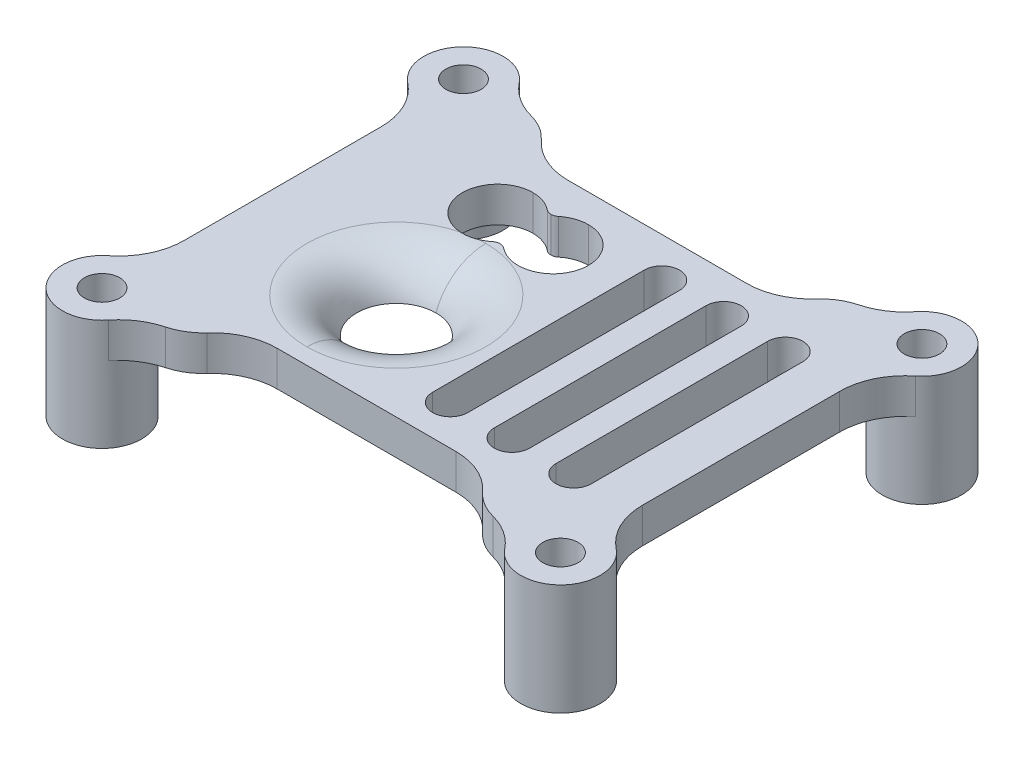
ISO-10303-21;
HEADER;
FILE_DESCRIPTION(('STEP AP214'),'2;1');
FILE_NAME('part.step','',(''),(''),'','','');
FILE_SCHEMA(('AUTOMOTIVE_DESIGN { 1 0 10303 214 1 1 1 1 }'));
ENDSEC;
DATA;
#1=APPLICATION_CONTEXT('core data for automotive mechanical design processes');
#2=APPLICATION_PROTOCOL_DEFINITION('international standard','automotive_design',2000,#1);
#3=PRODUCT_CONTEXT('',#1,'mechanical');
#4=PRODUCT('Part','Part','',(#3));
#5=PRODUCT_RELATED_PRODUCT_CATEGORY('part','',(#4));
#6=PRODUCT_DEFINITION_FORMATION('','',#4);
#7=PRODUCT_DEFINITION_CONTEXT('part definition',#1,'design');
#8=PRODUCT_DEFINITION('design','',#6,#7);
#9=PRODUCT_DEFINITION_SHAPE('','',#8);
#10=(LENGTH_UNIT() NAMED_UNIT(*) SI_UNIT(.MILLI.,.METRE.));
#11=(NAMED_UNIT(*) PLANE_ANGLE_UNIT() SI_UNIT($,.RADIAN.));
#12=(NAMED_UNIT(*) SI_UNIT($,.STERADIAN.) SOLID_ANGLE_UNIT());
#13=UNCERTAINTY_MEASURE_WITH_UNIT(LENGTH_MEASURE(1.E-05),#10,'distance_accuracy_value','');
#14=(GEOMETRIC_REPRESENTATION_CONTEXT(3) GLOBAL_UNCERTAINTY_ASSIGNED_CONTEXT((#13)) GLOBAL_UNIT_ASSIGNED_CONTEXT((#10,
#11,#12)) REPRESENTATION_CONTEXT('',''));
#15=CARTESIAN_POINT('',(0.,0.,0.));
#16=DIRECTION('',(0.,0.,1.));
#17=DIRECTION('',(1.,0.,0.));
#18=AXIS2_PLACEMENT_3D('',#15,#16,#17);
#19=CARTESIAN_POINT('',(0.,0.,-10.25));
#20=DIRECTION('',(0.,-1.,0.));
#21=DIRECTION('',(0.,0.,-1.));
#22=AXIS2_PLACEMENT_3D('',#19,#20,#21);
#23=PLANE('',#22);
#24=CARTESIAN_POINT('',(-4.3,0.,2.26));
#25=DIRECTION('',(0.,1.,0.));
#26=DIRECTION('',(0.,0.,1.));
#27=AXIS2_PLACEMENT_3D('',#24,#25,#26);
#28=CIRCLE('',#27,2.25);
#29=CARTESIAN_POINT('',(-4.3,0.,0.0100000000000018));
#30=VERTEX_POINT('',#29);
#31=CARTESIAN_POINT('',(-4.3,0.,4.51));
#32=VERTEX_POINT('',#31);
#33=EDGE_CURVE('E894',#30,#32,#28,.T.);
#34=ORIENTED_EDGE('',*,*,#33,.T.);
#35=CARTESIAN_POINT('',(-4.3,0.,2.26));
#36=DIRECTION('',(0.,1.,0.));
#37=DIRECTION('',(0.,0.,1.));
#38=AXIS2_PLACEMENT_3D('',#35,#36,#37);
#39=CIRCLE('',#38,2.25);
#40=EDGE_CURVE('E1001',#32,#30,#39,.T.);
#41=ORIENTED_EDGE('',*,*,#40,.T.);
#42=EDGE_LOOP('',(#34,#41));
#43=FACE_BOUND('',#42,.T.);
#44=CARTESIAN_POINT('',(-2.31,0.,-4.65));
#45=DIRECTION('',(0.,1.,0.));
#46=DIRECTION('',(0.,0.,1.));
#47=AXIS2_PLACEMENT_3D('',#44,#45,#46);
#48=CIRCLE('',#47,2.);
#49=CARTESIAN_POINT('',(-3.57,0.,-3.09680973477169));
#50=VERTEX_POINT('',#49);
#51=CARTESIAN_POINT('',(-2.31,0.,-2.65));
#52=VERTEX_POINT('',#51);
#53=EDGE_CURVE('E1102',#50,#52,#48,.T.);
#54=ORIENTED_EDGE('',*,*,#53,.T.);
#55=CARTESIAN_POINT('',(-2.31,0.,-4.65));
#56=DIRECTION('',(0.,1.,0.));
#57=DIRECTION('',(0.,0.,1.));
#58=AXIS2_PLACEMENT_3D('',#55,#56,#57);
#59=CIRCLE('',#58,2.);
#60=CARTESIAN_POINT('',(-2.31,0.,-6.65));
#61=VERTEX_POINT('',#60);
#62=EDGE_CURVE('E1058',#52,#61,#59,.T.);
#63=ORIENTED_EDGE('',*,*,#62,.T.);
#64=CARTESIAN_POINT('',(-2.31,0.,-4.65));
#65=DIRECTION('',(0.,1.,0.));
#66=DIRECTION('',(0.,0.,1.));
#67=AXIS2_PLACEMENT_3D('',#64,#65,#66);
#68=CIRCLE('',#67,2.);
#69=CARTESIAN_POINT('',(-3.57,0.,-6.20319026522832));
#70=VERTEX_POINT('',#69);
#71=EDGE_CURVE('E993',#61,#70,#68,.T.);
#72=ORIENTED_EDGE('',*,*,#71,.T.);
#73=CARTESIAN_POINT('',(-3.885,0.,-6.59148783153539));
#74=DIRECTION('',(0.,-1.,0.));
#75=DIRECTION('',(0.,0.,-1.));
#76=AXIS2_PLACEMENT_3D('',#73,#74,#75);
#77=CIRCLE('',#76,0.5);
#78=CARTESIAN_POINT('',(-3.885,0.,-6.09148783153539));
#79=VERTEX_POINT('',#78);
#80=EDGE_CURVE('E949',#70,#79,#77,.T.);
#81=ORIENTED_EDGE('',*,*,#80,.T.);
#82=CARTESIAN_POINT('',(-3.885,0.,-6.59148783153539));
#83=DIRECTION('',(0.,-1.,0.));
#84=DIRECTION('',(0.,0.,-1.));
#85=AXIS2_PLACEMENT_3D('',#82,#83,#84);
#86=CIRCLE('',#85,0.5);
#87=CARTESIAN_POINT('',(-4.2,0.,-6.20319026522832));
#88=VERTEX_POINT('',#87);
#89=EDGE_CURVE('E1041',#79,#88,#86,.T.);
#90=ORIENTED_EDGE('',*,*,#89,.T.);
#91=CARTESIAN_POINT('',(-5.46,0.,-4.65));
#92=DIRECTION('',(0.,1.,0.));
#93=DIRECTION('',(0.,0.,1.));
#94=AXIS2_PLACEMENT_3D('',#91,#92,#93);
#95=CIRCLE('',#94,2.);
#96=CARTESIAN_POINT('',(-5.46,0.,-6.65));
#97=VERTEX_POINT('',#96);
#98=EDGE_CURVE('E946',#88,#97,#95,.T.);
#99=ORIENTED_EDGE('',*,*,#98,.T.);
#100=CARTESIAN_POINT('',(-5.46,0.,-4.65));
#101=DIRECTION('',(0.,1.,0.));
#102=DIRECTION('',(0.,0.,1.));
#103=AXIS2_PLACEMENT_3D('',#100,#101,#102);
#104=CIRCLE('',#103,2.);
#105=CARTESIAN_POINT('',(-5.46,0.,-2.65));
#106=VERTEX_POINT('',#105);
#107=EDGE_CURVE('E973',#97,#106,#104,.T.);
#108=ORIENTED_EDGE('',*,*,#107,.T.);
#109=CARTESIAN_POINT('',(-5.46,0.,-4.65));
#110=DIRECTION('',(0.,1.,0.));
#111=DIRECTION('',(0.,0.,1.));
#112=AXIS2_PLACEMENT_3D('',#109,#110,#111);
#113=CIRCLE('',#112,2.);
#114=CARTESIAN_POINT('',(-4.2,0.,-3.09680973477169));
#115=VERTEX_POINT('',#114);
#116=EDGE_CURVE('E753',#106,#115,#113,.T.);
#117=ORIENTED_EDGE('',*,*,#116,.T.);
#118=CARTESIAN_POINT('',(-3.885,0.,-2.70851216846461));
#119=DIRECTION('',(0.,-1.,0.));
#120=DIRECTION('',(0.,0.,-1.));
#121=AXIS2_PLACEMENT_3D('',#118,#119,#120);
#122=CIRCLE('',#121,0.5);
#123=EDGE_CURVE('E898',#115,#50,#122,.T.);
#124=ORIENTED_EDGE('',*,*,#123,.T.);
#125=EDGE_LOOP('',(#54,#63,#72,#81,#90,#99,#108,#117,#124));
#126=FACE_BOUND('',#125,.T.);
#127=CARTESIAN_POINT('',(9.5,0.,6.));
#128=DIRECTION('',(0.,-1.,0.));
#129=DIRECTION('',(0.,0.,-1.));
#130=AXIS2_PLACEMENT_3D('',#127,#128,#129);
#131=CIRCLE('',#130,1.);
#132=CARTESIAN_POINT('',(10.5,0.,6.));
#133=VERTEX_POINT('',#132);
#134=CARTESIAN_POINT('',(9.5,0.,7.));
#135=VERTEX_POINT('',#134);
#136=EDGE_CURVE('E862',#133,#135,#131,.T.);
#137=ORIENTED_EDGE('',*,*,#136,.F.);
#138=DIRECTION('',(0.,0.,1.));
#139=VECTOR('',#138,1.);
#140=CARTESIAN_POINT('',(10.5,0.,-10.25));
#141=LINE('',#140,#139);
#142=CARTESIAN_POINT('',(10.5,0.,-6.));
#143=VERTEX_POINT('',#142);
#144=EDGE_CURVE('E1187',#143,#133,#141,.T.);
#145=ORIENTED_EDGE('',*,*,#144,.F.);
#146=CARTESIAN_POINT('',(9.5,0.,-6.));
#147=DIRECTION('',(0.,-1.,0.));
#148=DIRECTION('',(0.,0.,-1.));
#149=AXIS2_PLACEMENT_3D('',#146,#147,#148);
#150=CIRCLE('',#149,1.);
#151=CARTESIAN_POINT('',(8.5,0.,-6.));
#152=VERTEX_POINT('',#151);
#153=EDGE_CURVE('E1190',#152,#143,#150,.T.);
#154=ORIENTED_EDGE('',*,*,#153,.F.);
#155=DIRECTION('',(0.,0.,-1.));
#156=VECTOR('',#155,1.);
#157=CARTESIAN_POINT('',(8.5,0.,-10.25));
#158=LINE('',#157,#156);
#159=CARTESIAN_POINT('',(8.5,0.,6.));
#160=VERTEX_POINT('',#159);
#161=EDGE_CURVE('E1103',#160,#152,#158,.T.);
#162=ORIENTED_EDGE('',*,*,#161,.F.);
#163=CARTESIAN_POINT('',(9.5,0.,6.));
#164=DIRECTION('',(0.,-1.,0.));
#165=DIRECTION('',(0.,0.,-1.));
#166=AXIS2_PLACEMENT_3D('',#163,#164,#165);
#167=CIRCLE('',#166,1.);
#168=EDGE_CURVE('E1098',#135,#160,#167,.T.);
#169=ORIENTED_EDGE('',*,*,#168,.F.);
#170=EDGE_LOOP('',(#137,#145,#154,#162,#169));
#171=FACE_BOUND('',#170,.T.);
#172=CARTESIAN_POINT('',(6.,0.,6.));
#173=DIRECTION('',(0.,-1.,0.));
#174=DIRECTION('',(0.,0.,-1.));
#175=AXIS2_PLACEMENT_3D('',#172,#173,#174);
#176=CIRCLE('',#175,1.);
#177=CARTESIAN_POINT('',(7.,0.,6.));
#178=VERTEX_POINT('',#177);
#179=CARTESIAN_POINT('',(6.,0.,7.));
#180=VERTEX_POINT('',#179);
#181=EDGE_CURVE('E1010',#178,#180,#176,.T.);
#182=ORIENTED_EDGE('',*,*,#181,.F.);
#183=DIRECTION('',(0.,0.,1.));
#184=VECTOR('',#183,1.);
#185=CARTESIAN_POINT('',(7.,0.,-10.25));
#186=LINE('',#185,#184);
#187=CARTESIAN_POINT('',(7.,0.,-6.));
#188=VERTEX_POINT('',#187);
#189=EDGE_CURVE('E1161',#188,#178,#186,.T.);
#190=ORIENTED_EDGE('',*,*,#189,.F.);
#191=CARTESIAN_POINT('',(6.,0.,-6.));
#192=DIRECTION('',(0.,-1.,0.));
#193=DIRECTION('',(0.,0.,-1.));
#194=AXIS2_PLACEMENT_3D('',#191,#192,#193);
#195=CIRCLE('',#194,1.);
#196=CARTESIAN_POINT('',(5.,0.,-6.));
#197=VERTEX_POINT('',#196);
#198=EDGE_CURVE('E1064',#197,#188,#195,.T.);
#199=ORIENTED_EDGE('',*,*,#198,.F.);
#200=DIRECTION('',(0.,0.,-1.));
#201=VECTOR('',#200,1.);
#202=CARTESIAN_POINT('',(5.,0.,-10.25));
#203=LINE('',#202,#201);
#204=CARTESIAN_POINT('',(5.,0.,6.));
#205=VERTEX_POINT('',#204);
#206=EDGE_CURVE('E1059',#205,#197,#203,.T.);
#207=ORIENTED_EDGE('',*,*,#206,.F.);
#208=CARTESIAN_POINT('',(6.,0.,6.));
#209=DIRECTION('',(0.,-1.,0.));
#210=DIRECTION('',(0.,0.,-1.));
#211=AXIS2_PLACEMENT_3D('',#208,#209,#210);
#212=CIRCLE('',#211,1.);
#213=EDGE_CURVE('E1063',#180,#205,#212,.T.);
#214=ORIENTED_EDGE('',*,*,#213,.F.);
#215=EDGE_LOOP('',(#182,#190,#199,#207,#214));
#216=FACE_BOUND('',#215,.T.);
#217=CARTESIAN_POINT('',(2.5,0.,6.));
#218=DIRECTION('',(0.,-1.,0.));
#219=DIRECTION('',(0.,0.,-1.));
#220=AXIS2_PLACEMENT_3D('',#217,#218,#219);
#221=CIRCLE('',#220,1.);
#222=CARTESIAN_POINT('',(3.5,0.,6.));
#223=VERTEX_POINT('',#222);
#224=CARTESIAN_POINT('',(2.5,0.,7.));
#225=VERTEX_POINT('',#224);
#226=EDGE_CURVE('E927',#223,#225,#221,.T.);
#227=ORIENTED_EDGE('',*,*,#226,.F.);
#228=DIRECTION('',(0.,0.,1.));
#229=VECTOR('',#228,1.);
#230=CARTESIAN_POINT('',(3.5,0.,-10.25));
#231=LINE('',#230,#229);
#232=CARTESIAN_POINT('',(3.5,0.,-6.));
#233=VERTEX_POINT('',#232);
#234=EDGE_CURVE('E958',#233,#223,#231,.T.);
#235=ORIENTED_EDGE('',*,*,#234,.F.);
#236=CARTESIAN_POINT('',(2.5,0.,-6.));
#237=DIRECTION('',(0.,-1.,0.));
#238=DIRECTION('',(0.,0.,-1.));
#239=AXIS2_PLACEMENT_3D('',#236,#237,#238);
#240=CIRCLE('',#239,1.);
#241=CARTESIAN_POINT('',(1.5,0.,-6.));
#242=VERTEX_POINT('',#241);
#243=EDGE_CURVE('E961',#242,#233,#240,.T.);
#244=ORIENTED_EDGE('',*,*,#243,.F.);
#245=DIRECTION('',(0.,0.,-1.));
#246=VECTOR('',#245,1.);
#247=CARTESIAN_POINT('',(1.5,0.,-10.25));
#248=LINE('',#247,#246);
#249=CARTESIAN_POINT('',(1.5,0.,6.));
#250=VERTEX_POINT('',#249);
#251=EDGE_CURVE('E1111',#250,#242,#248,.T.);
#252=ORIENTED_EDGE('',*,*,#251,.F.);
#253=CARTESIAN_POINT('',(2.5,0.,6.));
#254=DIRECTION('',(0.,-1.,0.));
#255=DIRECTION('',(0.,0.,-1.));
#256=AXIS2_PLACEMENT_3D('',#253,#254,#255);
#257=CIRCLE('',#256,1.);
#258=EDGE_CURVE('E1115',#225,#250,#257,.T.);
#259=ORIENTED_EDGE('',*,*,#258,.F.);
#260=EDGE_LOOP('',(#227,#235,#244,#252,#259));
#261=FACE_BOUND('',#260,.T.);
#262=CARTESIAN_POINT('',(8.34032258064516,0.,-13.9499873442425));
#263=DIRECTION('',(0.,1.,0.));
#264=DIRECTION('',(0.,0.,-1.));
#265=AXIS2_PLACEMENT_3D('',#262,#263,#264);
#266=CIRCLE('',#265,3.7);
#267=CARTESIAN_POINT('',(9.2824490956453,0.,-10.3719435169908));
#268=VERTEX_POINT('',#267);
#269=CARTESIAN_POINT('',(11.237937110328,0.,-11.6491548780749));
#270=VERTEX_POINT('',#269);
#271=EDGE_CURVE('E1082',#268,#270,#266,.T.);
#272=ORIENTED_EDGE('',*,*,#271,.T.);
#273=CARTESIAN_POINT('',(13.,0.,-10.25));
#274=DIRECTION('',(0.,-1.,0.));
#275=DIRECTION('',(0.,0.,1.));
#276=AXIS2_PLACEMENT_3D('',#273,#274,#275);
#277=CIRCLE('',#276,2.24999999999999);
#278=CARTESIAN_POINT('',(14.3991596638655,0.,-8.48794091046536));
#279=VERTEX_POINT('',#278);
#280=EDGE_CURVE('E784',#279,#270,#277,.T.);
#281=ORIENTED_EDGE('',*,*,#280,.F.);
#282=CARTESIAN_POINT('',(16.7,0.,-5.59033262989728));
#283=DIRECTION('',(0.,1.,0.));
#284=DIRECTION('',(0.,0.,-1.));
#285=AXIS2_PLACEMENT_3D('',#282,#283,#284);
#286=CIRCLE('',#285,3.7);
#287=CARTESIAN_POINT('',(13.,0.,-5.59033262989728));
#288=VERTEX_POINT('',#287);
#289=EDGE_CURVE('E972',#279,#288,#286,.T.);
#290=ORIENTED_EDGE('',*,*,#289,.T.);
#291=DIRECTION('',(0.,0.,-1.));
#292=VECTOR('',#291,1.);
#293=CARTESIAN_POINT('',(13.,0.,-7.53));
#294=LINE('',#293,#292);
#295=CARTESIAN_POINT('',(13.,0.,5.59033262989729));
#296=VERTEX_POINT('',#295);
#297=EDGE_CURVE('E967',#296,#288,#294,.T.);
#298=ORIENTED_EDGE('',*,*,#297,.F.);
#299=CARTESIAN_POINT('',(16.7,0.,5.59033262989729));
#300=DIRECTION('',(0.,1.,0.));
#301=DIRECTION('',(0.,0.,-1.));
#302=AXIS2_PLACEMENT_3D('',#299,#300,#301);
#303=CIRCLE('',#302,3.7);
#304=CARTESIAN_POINT('',(14.3991596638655,0.,8.48794091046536));
#305=VERTEX_POINT('',#304);
#306=EDGE_CURVE('E971',#296,#305,#303,.T.);
#307=ORIENTED_EDGE('',*,*,#306,.T.);
#308=CARTESIAN_POINT('',(13.,0.,10.25));
#309=DIRECTION('',(0.,1.,0.));
#310=DIRECTION('',(0.,0.,-1.));
#311=AXIS2_PLACEMENT_3D('',#308,#309,#310);
#312=CIRCLE('',#311,2.24999999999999);
#313=CARTESIAN_POINT('',(11.237937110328,0.,11.6491548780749));
#314=VERTEX_POINT('',#313);
#315=EDGE_CURVE('E821',#305,#314,#312,.T.);
#316=ORIENTED_EDGE('',*,*,#315,.T.);
#317=CARTESIAN_POINT('',(8.34032258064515,0.,13.9499873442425));
#318=DIRECTION('',(0.,1.,0.));
#319=DIRECTION('',(0.,0.,-1.));
#320=AXIS2_PLACEMENT_3D('',#317,#318,#319);
#321=CIRCLE('',#320,3.7);
#322=CARTESIAN_POINT('',(9.2824490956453,0.,10.3719435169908));
#323=VERTEX_POINT('',#322);
#324=EDGE_CURVE('E1150',#314,#323,#321,.T.);
#325=ORIENTED_EDGE('',*,*,#324,.T.);
#326=CARTESIAN_POINT('',(10.0463354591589,0.,7.47082690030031));
#327=DIRECTION('',(0.,-1.,0.));
#328=DIRECTION('',(0.,0.,-1.));
#329=AXIS2_PLACEMENT_3D('',#326,#327,#328);
#330=CIRCLE('',#329,3.);
#331=CARTESIAN_POINT('',(7.81528883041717,0.,9.47642679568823));
#332=VERTEX_POINT('',#331);
#333=EDGE_CURVE('E1121',#323,#332,#330,.T.);
#334=ORIENTED_EDGE('',*,*,#333,.T.);
#335=CARTESIAN_POINT('',(5.063664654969,0.,11.95));
#336=DIRECTION('',(0.,1.,0.));
#337=DIRECTION('',(0.,0.,-1.));
#338=AXIS2_PLACEMENT_3D('',#335,#336,#337);
#339=CIRCLE('',#338,3.7);
#340=CARTESIAN_POINT('',(5.063664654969,0.,8.25));
#341=VERTEX_POINT('',#340);
#342=EDGE_CURVE('E1116',#332,#341,#339,.T.);
#343=ORIENTED_EDGE('',*,*,#342,.T.);
#344=DIRECTION('',(1.,0.,0.));
#345=VECTOR('',#344,1.);
#346=CARTESIAN_POINT('',(0.,0.,8.25));
#347=LINE('',#346,#345);
#348=CARTESIAN_POINT('',(-5.063664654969,0.,8.25));
#349=VERTEX_POINT('',#348);
#350=EDGE_CURVE('E1120',#349,#341,#347,.T.);
#351=ORIENTED_EDGE('',*,*,#350,.F.);
#352=CARTESIAN_POINT('',(-5.063664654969,0.,11.95));
#353=DIRECTION('',(0.,1.,0.));
#354=DIRECTION('',(0.,0.,-1.));
#355=AXIS2_PLACEMENT_3D('',#352,#353,#354);
#356=CIRCLE('',#355,3.7);
#357=CARTESIAN_POINT('',(-7.81528883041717,0.,9.47642679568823));
#358=VERTEX_POINT('',#357);
#359=EDGE_CURVE('E1157',#349,#358,#356,.T.);
#360=ORIENTED_EDGE('',*,*,#359,.T.);
#361=CARTESIAN_POINT('',(-10.0463354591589,0.,7.47082690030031));
#362=DIRECTION('',(0.,-1.,0.));
#363=DIRECTION('',(0.,0.,-1.));
#364=AXIS2_PLACEMENT_3D('',#361,#362,#363);
#365=CIRCLE('',#364,3.);
#366=CARTESIAN_POINT('',(-9.2824490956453,0.,10.3719435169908));
#367=VERTEX_POINT('',#366);
#368=EDGE_CURVE('E1014',#358,#367,#365,.T.);
#369=ORIENTED_EDGE('',*,*,#368,.T.);
#370=CARTESIAN_POINT('',(-8.34032258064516,0.,13.9499873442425));
#371=DIRECTION('',(0.,1.,0.));
#372=DIRECTION('',(0.,0.,-1.));
#373=AXIS2_PLACEMENT_3D('',#370,#371,#372);
#374=CIRCLE('',#373,3.7);
#375=CARTESIAN_POINT('',(-11.237937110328,0.,11.6491548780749));
#376=VERTEX_POINT('',#375);
#377=EDGE_CURVE('E942',#367,#376,#374,.T.);
#378=ORIENTED_EDGE('',*,*,#377,.T.);
#379=CARTESIAN_POINT('',(-13.,0.,10.25));
#380=DIRECTION('',(0.,-1.,0.));
#381=DIRECTION('',(0.,0.,-1.));
#382=AXIS2_PLACEMENT_3D('',#379,#380,#381);
#383=CIRCLE('',#382,2.24999999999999);
#384=CARTESIAN_POINT('',(-14.3991596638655,0.,8.48794091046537));
#385=VERTEX_POINT('',#384);
#386=EDGE_CURVE('E827',#385,#376,#383,.T.);
#387=ORIENTED_EDGE('',*,*,#386,.F.);
#388=CARTESIAN_POINT('',(-16.7,0.,5.59033262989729));
#389=DIRECTION('',(0.,1.,0.));
#390=DIRECTION('',(0.,0.,-1.));
#391=AXIS2_PLACEMENT_3D('',#388,#389,#390);
#392=CIRCLE('',#391,3.7);
#393=CARTESIAN_POINT('',(-13.,0.,5.59033262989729));
#394=VERTEX_POINT('',#393);
#395=EDGE_CURVE('E937',#385,#394,#392,.T.);
#396=ORIENTED_EDGE('',*,*,#395,.T.);
#397=DIRECTION('',(0.,0.,1.));
#398=VECTOR('',#397,1.);
#399=CARTESIAN_POINT('',(-13.,0.,-7.53));
#400=LINE('',#399,#398);
#401=CARTESIAN_POINT('',(-13.,0.,3.4));
#402=VERTEX_POINT('',#401);
#403=EDGE_CURVE('E941',#402,#394,#400,.T.);
#404=ORIENTED_EDGE('',*,*,#403,.F.);
#405=DIRECTION('',(-1.,0.,0.));
#406=VECTOR('',#405,1.);
#407=CARTESIAN_POINT('',(-11.2,0.,3.4));
#408=LINE('',#407,#406);
#409=CARTESIAN_POINT('',(-11.2,0.,3.4));
#410=VERTEX_POINT('',#409);
#411=EDGE_CURVE('E851',#410,#402,#408,.T.);
#412=ORIENTED_EDGE('',*,*,#411,.F.);
#413=DIRECTION('',(0.,0.,1.));
#414=VECTOR('',#413,1.);
#415=CARTESIAN_POINT('',(-11.2,0.,-3.4));
#416=LINE('',#415,#414);
#417=CARTESIAN_POINT('',(-11.2,0.,-3.4));
#418=VERTEX_POINT('',#417);
#419=EDGE_CURVE('E848',#418,#410,#416,.T.);
#420=ORIENTED_EDGE('',*,*,#419,.F.);
#421=DIRECTION('',(1.,0.,0.));
#422=VECTOR('',#421,1.);
#423=CARTESIAN_POINT('',(-11.2,0.,-3.4));
#424=LINE('',#423,#422);
#425=CARTESIAN_POINT('',(-13.,0.,-3.4));
#426=VERTEX_POINT('',#425);
#427=EDGE_CURVE('E509',#426,#418,#424,.T.);
#428=ORIENTED_EDGE('',*,*,#427,.F.);
#429=DIRECTION('',(0.,0.,1.));
#430=VECTOR('',#429,1.);
#431=CARTESIAN_POINT('',(-13.,0.,-7.53));
#432=LINE('',#431,#430);
#433=CARTESIAN_POINT('',(-13.,0.,-5.59033262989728));
#434=VERTEX_POINT('',#433);
#435=EDGE_CURVE('E963',#434,#426,#432,.T.);
#436=ORIENTED_EDGE('',*,*,#435,.F.);
#437=CARTESIAN_POINT('',(-16.7,0.,-5.59033262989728));
#438=DIRECTION('',(0.,1.,0.));
#439=DIRECTION('',(0.,0.,-1.));
#440=AXIS2_PLACEMENT_3D('',#437,#438,#439);
#441=CIRCLE('',#440,3.7);
#442=CARTESIAN_POINT('',(-14.3991596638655,0.,-8.48794091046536));
#443=VERTEX_POINT('',#442);
#444=EDGE_CURVE('E962',#434,#443,#441,.T.);
#445=ORIENTED_EDGE('',*,*,#444,.T.);
#446=CARTESIAN_POINT('',(-13.,0.,-10.25));
#447=DIRECTION('',(0.,1.,0.));
#448=DIRECTION('',(0.,0.,1.));
#449=AXIS2_PLACEMENT_3D('',#446,#447,#448);
#450=CIRCLE('',#449,2.24999999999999);
#451=CARTESIAN_POINT('',(-11.237937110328,0.,-11.6491548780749));
#452=VERTEX_POINT('',#451);
#453=EDGE_CURVE('E816',#443,#452,#450,.T.);
#454=ORIENTED_EDGE('',*,*,#453,.T.);
#455=CARTESIAN_POINT('',(-8.34032258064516,0.,-13.9499873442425));
#456=DIRECTION('',(0.,1.,0.));
#457=DIRECTION('',(0.,0.,-1.));
#458=AXIS2_PLACEMENT_3D('',#455,#456,#457);
#459=CIRCLE('',#458,3.7);
#460=CARTESIAN_POINT('',(-9.2824490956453,0.,-10.3719435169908));
#461=VERTEX_POINT('',#460);
#462=EDGE_CURVE('E884',#452,#461,#459,.T.);
#463=ORIENTED_EDGE('',*,*,#462,.T.);
#464=CARTESIAN_POINT('',(-10.0463354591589,0.,-7.47082690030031));
#465=DIRECTION('',(0.,-1.,0.));
#466=DIRECTION('',(0.,0.,-1.));
#467=AXIS2_PLACEMENT_3D('',#464,#465,#466);
#468=CIRCLE('',#467,3.);
#469=CARTESIAN_POINT('',(-7.81528883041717,0.,-9.47642679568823));
#470=VERTEX_POINT('',#469);
#471=EDGE_CURVE('E879',#461,#470,#468,.T.);
#472=ORIENTED_EDGE('',*,*,#471,.T.);
#473=CARTESIAN_POINT('',(-5.063664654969,0.,-11.95));
#474=DIRECTION('',(0.,1.,0.));
#475=DIRECTION('',(0.,0.,-1.));
#476=AXIS2_PLACEMENT_3D('',#473,#474,#475);
#477=CIRCLE('',#476,3.7);
#478=CARTESIAN_POINT('',(-5.063664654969,0.,-8.25));
#479=VERTEX_POINT('',#478);
#480=EDGE_CURVE('E883',#470,#479,#477,.T.);
#481=ORIENTED_EDGE('',*,*,#480,.T.);
#482=DIRECTION('',(-1.,0.,0.));
#483=VECTOR('',#482,1.);
#484=CARTESIAN_POINT('',(0.,0.,-8.25));
#485=LINE('',#484,#483);
#486=CARTESIAN_POINT('',(5.063664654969,0.,-8.25));
#487=VERTEX_POINT('',#486);
#488=EDGE_CURVE('E953',#487,#479,#485,.T.);
#489=ORIENTED_EDGE('',*,*,#488,.F.);
#490=CARTESIAN_POINT('',(5.063664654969,0.,-11.95));
#491=DIRECTION('',(0.,1.,0.));
#492=DIRECTION('',(0.,0.,-1.));
#493=AXIS2_PLACEMENT_3D('',#490,#491,#492);
#494=CIRCLE('',#493,3.7);
#495=CARTESIAN_POINT('',(7.81528883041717,0.,-9.47642679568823));
#496=VERTEX_POINT('',#495);
#497=EDGE_CURVE('E957',#487,#496,#494,.T.);
#498=ORIENTED_EDGE('',*,*,#497,.T.);
#499=CARTESIAN_POINT('',(10.0463354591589,0.,-7.47082690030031));
#500=DIRECTION('',(0.,-1.,0.));
#501=DIRECTION('',(0.,0.,-1.));
#502=AXIS2_PLACEMENT_3D('',#499,#500,#501);
#503=CIRCLE('',#502,3.);
#504=EDGE_CURVE('E1045',#496,#268,#503,.T.);
#505=ORIENTED_EDGE('',*,*,#504,.T.);
#506=EDGE_LOOP('',(#272,#281,#290,#298,#307,#316,#325,#334,#343,#351,#360,#369,#378,#387,#396,
#404,#412,#420,#428,#436,#445,#454,#463,#472,#481,#489,#498,#505));
#507=FACE_BOUND('',#506,.T.);
#508=ADVANCED_FACE('F51',(#43,#126,#171,#216,#261,#507),#23,.T.);
#509=CARTESIAN_POINT('',(-10.0463354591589,2.,7.47082690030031));
#510=DIRECTION('',(0.,-1.,0.));
#511=DIRECTION('',(0.,0.,-1.));
#512=AXIS2_PLACEMENT_3D('',#509,#510,#511);
#513=CYLINDRICAL_SURFACE('',#512,3.);
#514=CARTESIAN_POINT('',(-10.0463354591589,2.,7.47082690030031));
#515=DIRECTION('',(0.,1.,0.));
#516=DIRECTION('',(0.,0.,-1.));
#517=AXIS2_PLACEMENT_3D('',#514,#515,#516);
#518=CIRCLE('',#517,3.);
#519=CARTESIAN_POINT('',(-9.2824490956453,2.,10.3719435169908));
#520=VERTEX_POINT('',#519);
#521=CARTESIAN_POINT('',(-7.81528883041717,2.,9.47642679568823));
#522=VERTEX_POINT('',#521);
#523=EDGE_CURVE('E842',#520,#522,#518,.T.);
#524=ORIENTED_EDGE('',*,*,#523,.F.);
#525=DIRECTION('',(0.,1.,0.));
#526=VECTOR('',#525,1.);
#527=CARTESIAN_POINT('',(-9.2824490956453,2.,10.3719435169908));
#528=LINE('',#527,#526);
#529=EDGE_CURVE('E61',#367,#520,#528,.T.);
#530=ORIENTED_EDGE('',*,*,#529,.F.);
#531=ORIENTED_EDGE('',*,*,#368,.F.);
#532=DIRECTION('',(0.,-1.,0.));
#533=VECTOR('',#532,1.);
#534=CARTESIAN_POINT('',(-7.81528883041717,-4.3,9.47642679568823));
#535=LINE('',#534,#533);
#536=EDGE_CURVE('E11',#522,#358,#535,.T.);
#537=ORIENTED_EDGE('',*,*,#536,.F.);
#538=EDGE_LOOP('',(#524,#530,#531,#537));
#539=FACE_BOUND('',#538,.T.);
#540=ADVANCED_FACE('F696',(#539),#513,.T.);
#541=CARTESIAN_POINT('',(10.0463354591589,-7.02864140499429,7.47082690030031));
#542=DIRECTION('',(0.,1.,0.));
#543=DIRECTION('',(0.,0.,1.));
#544=AXIS2_PLACEMENT_3D('',#541,#542,#543);
#545=CYLINDRICAL_SURFACE('',#544,3.);
#546=ORIENTED_EDGE('',*,*,#333,.F.);
#547=DIRECTION('',(0.,-1.,0.));
#548=VECTOR('',#547,1.);
#549=CARTESIAN_POINT('',(9.2824490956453,-7.02864140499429,10.3719435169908));
#550=LINE('',#549,#548);
#551=CARTESIAN_POINT('',(9.2824490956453,2.,10.3719435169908));
#552=VERTEX_POINT('',#551);
#553=EDGE_CURVE('E598',#552,#323,#550,.T.);
#554=ORIENTED_EDGE('',*,*,#553,.F.);
#555=CARTESIAN_POINT('',(10.0463354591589,2.,7.47082690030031));
#556=DIRECTION('',(0.,1.,0.));
#557=DIRECTION('',(0.,0.,-1.));
#558=AXIS2_PLACEMENT_3D('',#555,#556,#557);
#559=CIRCLE('',#558,3.);
#560=CARTESIAN_POINT('',(7.81528883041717,2.,9.47642679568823));
#561=VERTEX_POINT('',#560);
#562=EDGE_CURVE('E870',#561,#552,#559,.T.);
#563=ORIENTED_EDGE('',*,*,#562,.F.);
#564=DIRECTION('',(0.,1.,0.));
#565=VECTOR('',#564,1.);
#566=CARTESIAN_POINT('',(7.81528883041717,-4.3,9.47642679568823));
#567=LINE('',#566,#565);
#568=EDGE_CURVE('E601',#332,#561,#567,.T.);
#569=ORIENTED_EDGE('',*,*,#568,.F.);
#570=EDGE_LOOP('',(#546,#554,#563,#569));
#571=FACE_BOUND('',#570,.T.);
#572=ADVANCED_FACE('F1416',(#571),#545,.T.);
#573=CARTESIAN_POINT('',(10.0463354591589,2.,-7.47082690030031));
#574=DIRECTION('',(0.,-1.,0.));
#575=DIRECTION('',(0.,0.,-1.));
#576=AXIS2_PLACEMENT_3D('',#573,#574,#575);
#577=CYLINDRICAL_SURFACE('',#576,3.);
#578=CARTESIAN_POINT('',(10.0463354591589,2.,-7.47082690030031));
#579=DIRECTION('',(0.,1.,0.));
#580=DIRECTION('',(0.,0.,-1.));
#581=AXIS2_PLACEMENT_3D('',#578,#579,#580);
#582=CIRCLE('',#581,3.);
#583=CARTESIAN_POINT('',(9.2824490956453,2.,-10.3719435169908));
#584=VERTEX_POINT('',#583);
#585=CARTESIAN_POINT('',(7.81528883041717,2.,-9.47642679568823));
#586=VERTEX_POINT('',#585);
#587=EDGE_CURVE('E1257',#584,#586,#582,.T.);
#588=ORIENTED_EDGE('',*,*,#587,.F.);
#589=DIRECTION('',(0.,1.,0.));
#590=VECTOR('',#589,1.);
#591=CARTESIAN_POINT('',(9.2824490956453,2.,-10.3719435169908));
#592=LINE('',#591,#590);
#593=EDGE_CURVE('E604',#268,#584,#592,.T.);
#594=ORIENTED_EDGE('',*,*,#593,.F.);
#595=ORIENTED_EDGE('',*,*,#504,.F.);
#596=DIRECTION('',(0.,-1.,0.));
#597=VECTOR('',#596,1.);
#598=CARTESIAN_POINT('',(7.81528883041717,-4.3,-9.47642679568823));
#599=LINE('',#598,#597);
#600=EDGE_CURVE('E607',#586,#496,#599,.T.);
#601=ORIENTED_EDGE('',*,*,#600,.F.);
#602=EDGE_LOOP('',(#588,#594,#595,#601));
#603=FACE_BOUND('',#602,.T.);
#604=ADVANCED_FACE('F688',(#603),#577,.T.);
#605=CARTESIAN_POINT('',(-10.0463354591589,-7.02864140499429,-7.47082690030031));
#606=DIRECTION('',(0.,1.,0.));
#607=DIRECTION('',(0.,0.,1.));
#608=AXIS2_PLACEMENT_3D('',#605,#606,#607);
#609=CYLINDRICAL_SURFACE('',#608,3.);
#610=ORIENTED_EDGE('',*,*,#471,.F.);
#611=DIRECTION('',(0.,-1.,0.));
#612=VECTOR('',#611,1.);
#613=CARTESIAN_POINT('',(-9.2824490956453,-7.02864140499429,-10.3719435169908));
#614=LINE('',#613,#612);
#615=CARTESIAN_POINT('',(-9.2824490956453,2.,-10.3719435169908));
#616=VERTEX_POINT('',#615);
#617=EDGE_CURVE('E610',#616,#461,#614,.T.);
#618=ORIENTED_EDGE('',*,*,#617,.F.);
#619=CARTESIAN_POINT('',(-10.0463354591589,2.,-7.47082690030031));
#620=DIRECTION('',(0.,1.,0.));
#621=DIRECTION('',(0.,0.,-1.));
#622=AXIS2_PLACEMENT_3D('',#619,#620,#621);
#623=CIRCLE('',#622,3.);
#624=CARTESIAN_POINT('',(-7.81528883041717,2.,-9.47642679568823));
#625=VERTEX_POINT('',#624);
#626=EDGE_CURVE('E1202',#625,#616,#623,.T.);
#627=ORIENTED_EDGE('',*,*,#626,.F.);
#628=DIRECTION('',(0.,1.,0.));
#629=VECTOR('',#628,1.);
#630=CARTESIAN_POINT('',(-7.81528883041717,-4.3,-9.47642679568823));
#631=LINE('',#630,#629);
#632=EDGE_CURVE('E613',#470,#625,#631,.T.);
#633=ORIENTED_EDGE('',*,*,#632,.F.);
#634=EDGE_LOOP('',(#610,#618,#627,#633));
#635=FACE_BOUND('',#634,.T.);
#636=ADVANCED_FACE('F685',(#635),#609,.T.);
#637=CARTESIAN_POINT('',(-16.7,-7.02864140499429,5.59033262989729));
#638=DIRECTION('',(0.,1.,0.));
#639=DIRECTION('',(0.,0.,1.));
#640=AXIS2_PLACEMENT_3D('',#637,#638,#639);
#641=CYLINDRICAL_SURFACE('',#640,3.7);
#642=ORIENTED_EDGE('',*,*,#395,.F.);
#643=DIRECTION('',(0.,-1.,0.));
#644=VECTOR('',#643,1.);
#645=CARTESIAN_POINT('',(-14.3991596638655,-7.02864140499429,8.48794091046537));
#646=LINE('',#645,#644);
#647=CARTESIAN_POINT('',(-14.3991596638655,2.,8.48794091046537));
#648=VERTEX_POINT('',#647);
#649=EDGE_CURVE('E836',#648,#385,#646,.T.);
#650=ORIENTED_EDGE('',*,*,#649,.F.);
#651=CARTESIAN_POINT('',(-16.7,2.,5.59033262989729));
#652=DIRECTION('',(0.,-1.,0.));
#653=DIRECTION('',(0.,0.,-1.));
#654=AXIS2_PLACEMENT_3D('',#651,#652,#653);
#655=CIRCLE('',#654,3.7);
#656=CARTESIAN_POINT('',(-13.,2.,5.59033262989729));
#657=VERTEX_POINT('',#656);
#658=EDGE_CURVE('E914',#657,#648,#655,.T.);
#659=ORIENTED_EDGE('',*,*,#658,.F.);
#660=DIRECTION('',(0.,1.,0.));
#661=VECTOR('',#660,1.);
#662=CARTESIAN_POINT('',(-13.,2.,5.59033262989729));
#663=LINE('',#662,#661);
#664=EDGE_CURVE('E864',#394,#657,#663,.T.);
#665=ORIENTED_EDGE('',*,*,#664,.F.);
#666=EDGE_LOOP('',(#642,#650,#659,#665));
#667=FACE_BOUND('',#666,.T.);
#668=ADVANCED_FACE('F53',(#667),#641,.F.);
#669=CARTESIAN_POINT('',(-16.7,-7.02864140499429,-5.59033262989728));
#670=DIRECTION('',(0.,1.,0.));
#671=DIRECTION('',(0.,0.,1.));
#672=AXIS2_PLACEMENT_3D('',#669,#670,#671);
#673=CYLINDRICAL_SURFACE('',#672,3.7);
#674=ORIENTED_EDGE('',*,*,#444,.F.);
#675=DIRECTION('',(0.,-1.,0.));
#676=VECTOR('',#675,1.);
#677=CARTESIAN_POINT('',(-13.,2.,-5.59033262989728));
#678=LINE('',#677,#676);
#679=CARTESIAN_POINT('',(-13.,2.,-5.59033262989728));
#680=VERTEX_POINT('',#679);
#681=EDGE_CURVE('E915',#680,#434,#678,.T.);
#682=ORIENTED_EDGE('',*,*,#681,.F.);
#683=CARTESIAN_POINT('',(-16.7,2.,-5.59033262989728));
#684=DIRECTION('',(0.,-1.,0.));
#685=DIRECTION('',(0.,0.,-1.));
#686=AXIS2_PLACEMENT_3D('',#683,#684,#685);
#687=CIRCLE('',#686,3.7);
#688=CARTESIAN_POINT('',(-14.3991596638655,2.,-8.48794091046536));
#689=VERTEX_POINT('',#688);
#690=EDGE_CURVE('E856',#689,#680,#687,.T.);
#691=ORIENTED_EDGE('',*,*,#690,.F.);
#692=DIRECTION('',(0.,1.,0.));
#693=VECTOR('',#692,1.);
#694=CARTESIAN_POINT('',(-14.3991596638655,-7.02864140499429,-8.48794091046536));
#695=LINE('',#694,#693);
#696=EDGE_CURVE('E577',#443,#689,#695,.T.);
#697=ORIENTED_EDGE('',*,*,#696,.F.);
#698=EDGE_LOOP('',(#674,#682,#691,#697));
#699=FACE_BOUND('',#698,.T.);
#700=ADVANCED_FACE('F1514',(#699),#673,.F.);
#701=CARTESIAN_POINT('',(16.7,-7.02864140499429,-5.59033262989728));
#702=DIRECTION('',(0.,1.,0.));
#703=DIRECTION('',(0.,0.,1.));
#704=AXIS2_PLACEMENT_3D('',#701,#702,#703);
#705=CYLINDRICAL_SURFACE('',#704,3.7);
#706=ORIENTED_EDGE('',*,*,#289,.F.);
#707=DIRECTION('',(0.,-1.,0.));
#708=VECTOR('',#707,1.);
#709=CARTESIAN_POINT('',(14.3991596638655,-7.02864140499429,-8.48794091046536));
#710=LINE('',#709,#708);
#711=CARTESIAN_POINT('',(14.3991596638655,2.,-8.48794091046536));
#712=VERTEX_POINT('',#711);
#713=EDGE_CURVE('E580',#712,#279,#710,.T.);
#714=ORIENTED_EDGE('',*,*,#713,.F.);
#715=CARTESIAN_POINT('',(16.7,2.,-5.59033262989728));
#716=DIRECTION('',(0.,-1.,0.));
#717=DIRECTION('',(0.,0.,-1.));
#718=AXIS2_PLACEMENT_3D('',#715,#716,#717);
#719=CIRCLE('',#718,3.7);
#720=CARTESIAN_POINT('',(13.,2.,-5.59033262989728));
#721=VERTEX_POINT('',#720);
#722=EDGE_CURVE('E1245',#721,#712,#719,.T.);
#723=ORIENTED_EDGE('',*,*,#722,.F.);
#724=DIRECTION('',(0.,1.,0.));
#725=VECTOR('',#724,1.);
#726=CARTESIAN_POINT('',(13.,2.,-5.59033262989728));
#727=LINE('',#726,#725);
#728=EDGE_CURVE('E1219',#288,#721,#727,.T.);
#729=ORIENTED_EDGE('',*,*,#728,.F.);
#730=EDGE_LOOP('',(#706,#714,#723,#729));
#731=FACE_BOUND('',#730,.T.);
#732=ADVANCED_FACE('F1387',(#731),#705,.F.);
#733=CARTESIAN_POINT('',(16.7,-7.02864140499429,5.59033262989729));
#734=DIRECTION('',(0.,1.,0.));
#735=DIRECTION('',(0.,0.,1.));
#736=AXIS2_PLACEMENT_3D('',#733,#734,#735);
#737=CYLINDRICAL_SURFACE('',#736,3.7);
#738=ORIENTED_EDGE('',*,*,#306,.F.);
#739=DIRECTION('',(0.,-1.,0.));
#740=VECTOR('',#739,1.);
#741=CARTESIAN_POINT('',(13.,2.,5.59033262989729));
#742=LINE('',#741,#740);
#743=CARTESIAN_POINT('',(13.,2.,5.59033262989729));
#744=VERTEX_POINT('',#743);
#745=EDGE_CURVE('E1107',#744,#296,#742,.T.);
#746=ORIENTED_EDGE('',*,*,#745,.F.);
#747=CARTESIAN_POINT('',(16.7,2.,5.59033262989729));
#748=DIRECTION('',(0.,-1.,0.));
#749=DIRECTION('',(0.,0.,-1.));
#750=AXIS2_PLACEMENT_3D('',#747,#748,#749);
#751=CIRCLE('',#750,3.7);
#752=CARTESIAN_POINT('',(14.3991596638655,2.,8.48794091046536));
#753=VERTEX_POINT('',#752);
#754=EDGE_CURVE('E936',#753,#744,#751,.T.);
#755=ORIENTED_EDGE('',*,*,#754,.F.);
#756=DIRECTION('',(0.,1.,0.));
#757=VECTOR('',#756,1.);
#758=CARTESIAN_POINT('',(14.3991596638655,-7.02864140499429,8.48794091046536));
#759=LINE('',#758,#757);
#760=EDGE_CURVE('E581',#305,#753,#759,.T.);
#761=ORIENTED_EDGE('',*,*,#760,.F.);
#762=EDGE_LOOP('',(#738,#746,#755,#761));
#763=FACE_BOUND('',#762,.T.);
#764=ADVANCED_FACE('F1396',(#763),#737,.F.);
#765=CARTESIAN_POINT('',(-5.063664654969,-4.3,11.95));
#766=DIRECTION('',(0.,-1.,0.));
#767=DIRECTION('',(0.,0.,-1.));
#768=AXIS2_PLACEMENT_3D('',#765,#766,#767);
#769=CYLINDRICAL_SURFACE('',#768,3.7);
#770=CARTESIAN_POINT('',(-5.063664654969,2.,11.95));
#771=DIRECTION('',(0.,-1.,0.));
#772=DIRECTION('',(0.,0.,-1.));
#773=AXIS2_PLACEMENT_3D('',#770,#771,#772);
#774=CIRCLE('',#773,3.7);
#775=CARTESIAN_POINT('',(-5.063664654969,2.,8.25));
#776=VERTEX_POINT('',#775);
#777=EDGE_CURVE('E846',#522,#776,#774,.T.);
#778=ORIENTED_EDGE('',*,*,#777,.F.);
#779=ORIENTED_EDGE('',*,*,#536,.T.);
#780=ORIENTED_EDGE('',*,*,#359,.F.);
#781=DIRECTION('',(0.,-1.,0.));
#782=VECTOR('',#781,1.);
#783=CARTESIAN_POINT('',(-5.063664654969,-4.3,8.25));
#784=LINE('',#783,#782);
#785=EDGE_CURVE('E591',#776,#349,#784,.T.);
#786=ORIENTED_EDGE('',*,*,#785,.F.);
#787=EDGE_LOOP('',(#778,#779,#780,#786));
#788=FACE_BOUND('',#787,.T.);
#789=ADVANCED_FACE('F1424',(#788),#769,.F.);
#790=CARTESIAN_POINT('',(-8.34032258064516,2.,13.9499873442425));
#791=DIRECTION('',(0.,-1.,0.));
#792=DIRECTION('',(0.,0.,-1.));
#793=AXIS2_PLACEMENT_3D('',#790,#791,#792);
#794=CYLINDRICAL_SURFACE('',#793,3.7);
#795=ORIENTED_EDGE('',*,*,#377,.F.);
#796=ORIENTED_EDGE('',*,*,#529,.T.);
#797=CARTESIAN_POINT('',(-8.34032258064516,2.,13.9499873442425));
#798=DIRECTION('',(0.,-1.,0.));
#799=DIRECTION('',(0.,0.,-1.));
#800=AXIS2_PLACEMENT_3D('',#797,#798,#799);
#801=CIRCLE('',#800,3.7);
#802=CARTESIAN_POINT('',(-11.237937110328,2.,11.6491548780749));
#803=VERTEX_POINT('',#802);
#804=EDGE_CURVE('E847',#803,#520,#801,.T.);
#805=ORIENTED_EDGE('',*,*,#804,.F.);
#806=DIRECTION('',(0.,1.,0.));
#807=VECTOR('',#806,1.);
#808=CARTESIAN_POINT('',(-11.237937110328,-7.02864140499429,11.6491548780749));
#809=LINE('',#808,#807);
#810=EDGE_CURVE('E584',#376,#803,#809,.T.);
#811=ORIENTED_EDGE('',*,*,#810,.F.);
#812=EDGE_LOOP('',(#795,#796,#805,#811));
#813=FACE_BOUND('',#812,.T.);
#814=ADVANCED_FACE('F1433',(#813),#794,.F.);
#815=CARTESIAN_POINT('',(-5.063664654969,-4.3,-11.95));
#816=DIRECTION('',(0.,1.,0.));
#817=DIRECTION('',(0.,0.,1.));
#818=AXIS2_PLACEMENT_3D('',#815,#816,#817);
#819=CYLINDRICAL_SURFACE('',#818,3.7);
#820=ORIENTED_EDGE('',*,*,#480,.F.);
#821=ORIENTED_EDGE('',*,*,#632,.T.);
#822=CARTESIAN_POINT('',(-5.063664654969,2.,-11.95));
#823=DIRECTION('',(0.,-1.,0.));
#824=DIRECTION('',(0.,0.,-1.));
#825=AXIS2_PLACEMENT_3D('',#822,#823,#824);
#826=CIRCLE('',#825,3.7);
#827=CARTESIAN_POINT('',(-5.063664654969,2.,-8.25));
#828=VERTEX_POINT('',#827);
#829=EDGE_CURVE('E1223',#828,#625,#826,.T.);
#830=ORIENTED_EDGE('',*,*,#829,.F.);
#831=DIRECTION('',(0.,1.,0.));
#832=VECTOR('',#831,1.);
#833=CARTESIAN_POINT('',(-5.063664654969,-4.3,-8.25));
#834=LINE('',#833,#832);
#835=EDGE_CURVE('E597',#479,#828,#834,.T.);
#836=ORIENTED_EDGE('',*,*,#835,.F.);
#837=EDGE_LOOP('',(#820,#821,#830,#836));
#838=FACE_BOUND('',#837,.T.);
#839=ADVANCED_FACE('F1503',(#838),#819,.F.);
#840=CARTESIAN_POINT('',(-8.34032258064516,-7.02864140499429,-13.9499873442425));
#841=DIRECTION('',(0.,-1.,0.));
#842=DIRECTION('',(0.,0.,-1.));
#843=AXIS2_PLACEMENT_3D('',#840,#841,#842);
#844=CYLINDRICAL_SURFACE('',#843,3.7);
#845=CARTESIAN_POINT('',(-8.34032258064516,2.,-13.9499873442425));
#846=DIRECTION('',(0.,-1.,0.));
#847=DIRECTION('',(0.,0.,-1.));
#848=AXIS2_PLACEMENT_3D('',#845,#846,#847);
#849=CIRCLE('',#848,3.7);
#850=CARTESIAN_POINT('',(-11.237937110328,2.,-11.6491548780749));
#851=VERTEX_POINT('',#850);
#852=EDGE_CURVE('E857',#616,#851,#849,.T.);
#853=ORIENTED_EDGE('',*,*,#852,.F.);
#854=ORIENTED_EDGE('',*,*,#617,.T.);
#855=ORIENTED_EDGE('',*,*,#462,.F.);
#856=DIRECTION('',(0.,-1.,0.));
#857=VECTOR('',#856,1.);
#858=CARTESIAN_POINT('',(-11.237937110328,-7.02864140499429,-11.6491548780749));
#859=LINE('',#858,#857);
#860=EDGE_CURVE('E570',#851,#452,#859,.T.);
#861=ORIENTED_EDGE('',*,*,#860,.F.);
#862=EDGE_LOOP('',(#853,#854,#855,#861));
#863=FACE_BOUND('',#862,.T.);
#864=ADVANCED_FACE('F1497',(#863),#844,.F.);
#865=CARTESIAN_POINT('',(5.063664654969,-4.3,-11.95));
#866=DIRECTION('',(0.,-1.,0.));
#867=DIRECTION('',(0.,0.,-1.));
#868=AXIS2_PLACEMENT_3D('',#865,#866,#867);
#869=CYLINDRICAL_SURFACE('',#868,3.7);
#870=CARTESIAN_POINT('',(5.063664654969,2.,-11.95));
#871=DIRECTION('',(0.,-1.,0.));
#872=DIRECTION('',(0.,0.,-1.));
#873=AXIS2_PLACEMENT_3D('',#870,#871,#872);
#874=CIRCLE('',#873,3.7);
#875=CARTESIAN_POINT('',(5.063664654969,2.,-8.25));
#876=VERTEX_POINT('',#875);
#877=EDGE_CURVE('E1261',#586,#876,#874,.T.);
#878=ORIENTED_EDGE('',*,*,#877,.F.);
#879=ORIENTED_EDGE('',*,*,#600,.T.);
#880=ORIENTED_EDGE('',*,*,#497,.F.);
#881=DIRECTION('',(0.,-1.,0.));
#882=VECTOR('',#881,1.);
#883=CARTESIAN_POINT('',(5.063664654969,-4.3,-8.25));
#884=LINE('',#883,#882);
#885=EDGE_CURVE('E594',#876,#487,#884,.T.);
#886=ORIENTED_EDGE('',*,*,#885,.F.);
#887=EDGE_LOOP('',(#878,#879,#880,#886));
#888=FACE_BOUND('',#887,.T.);
#889=ADVANCED_FACE('F1509',(#888),#869,.F.);
#890=CARTESIAN_POINT('',(8.34032258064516,2.,-13.9499873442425));
#891=DIRECTION('',(0.,-1.,0.));
#892=DIRECTION('',(0.,0.,-1.));
#893=AXIS2_PLACEMENT_3D('',#890,#891,#892);
#894=CYLINDRICAL_SURFACE('',#893,3.7);
#895=ORIENTED_EDGE('',*,*,#271,.F.);
#896=ORIENTED_EDGE('',*,*,#593,.T.);
#897=CARTESIAN_POINT('',(8.34032258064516,2.,-13.9499873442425));
#898=DIRECTION('',(0.,-1.,0.));
#899=DIRECTION('',(0.,0.,-1.));
#900=AXIS2_PLACEMENT_3D('',#897,#898,#899);
#901=CIRCLE('',#900,3.7);
#902=CARTESIAN_POINT('',(11.237937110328,2.,-11.6491548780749));
#903=VERTEX_POINT('',#902);
#904=EDGE_CURVE('E1253',#903,#584,#901,.T.);
#905=ORIENTED_EDGE('',*,*,#904,.F.);
#906=DIRECTION('',(0.,1.,0.));
#907=VECTOR('',#906,1.);
#908=CARTESIAN_POINT('',(11.237937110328,-7.02864140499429,-11.6491548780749));
#909=LINE('',#908,#907);
#910=EDGE_CURVE('E585',#270,#903,#909,.T.);
#911=ORIENTED_EDGE('',*,*,#910,.F.);
#912=EDGE_LOOP('',(#895,#896,#905,#911));
#913=FACE_BOUND('',#912,.T.);
#914=ADVANCED_FACE('F732',(#913),#894,.F.);
#915=CARTESIAN_POINT('',(5.063664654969,-4.3,11.95));
#916=DIRECTION('',(0.,1.,0.));
#917=DIRECTION('',(0.,0.,1.));
#918=AXIS2_PLACEMENT_3D('',#915,#916,#917);
#919=CYLINDRICAL_SURFACE('',#918,3.7);
#920=ORIENTED_EDGE('',*,*,#342,.F.);
#921=ORIENTED_EDGE('',*,*,#568,.T.);
#922=CARTESIAN_POINT('',(5.063664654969,2.,11.95));
#923=DIRECTION('',(0.,-1.,0.));
#924=DIRECTION('',(0.,0.,-1.));
#925=AXIS2_PLACEMENT_3D('',#922,#923,#924);
#926=CIRCLE('',#925,3.7);
#927=CARTESIAN_POINT('',(5.063664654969,2.,8.25));
#928=VERTEX_POINT('',#927);
#929=EDGE_CURVE('E875',#928,#561,#926,.T.);
#930=ORIENTED_EDGE('',*,*,#929,.F.);
#931=DIRECTION('',(0.,1.,0.));
#932=VECTOR('',#931,1.);
#933=CARTESIAN_POINT('',(5.063664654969,-4.3,8.25));
#934=LINE('',#933,#932);
#935=EDGE_CURVE('E588',#341,#928,#934,.T.);
#936=ORIENTED_EDGE('',*,*,#935,.F.);
#937=EDGE_LOOP('',(#920,#921,#930,#936));
#938=FACE_BOUND('',#937,.T.);
#939=ADVANCED_FACE('F729',(#938),#919,.F.);
#940=CARTESIAN_POINT('',(8.34032258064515,-7.02864140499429,13.9499873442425));
#941=DIRECTION('',(0.,-1.,0.));
#942=DIRECTION('',(0.,0.,-1.));
#943=AXIS2_PLACEMENT_3D('',#940,#941,#942);
#944=CYLINDRICAL_SURFACE('',#943,3.7);
#945=CARTESIAN_POINT('',(8.34032258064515,2.,13.9499873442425));
#946=DIRECTION('',(0.,-1.,0.));
#947=DIRECTION('',(0.,0.,-1.));
#948=AXIS2_PLACEMENT_3D('',#945,#946,#947);
#949=CIRCLE('',#948,3.7);
#950=CARTESIAN_POINT('',(11.237937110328,2.,11.6491548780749));
#951=VERTEX_POINT('',#950);
#952=EDGE_CURVE('E874',#552,#951,#949,.T.);
#953=ORIENTED_EDGE('',*,*,#952,.F.);
#954=ORIENTED_EDGE('',*,*,#553,.T.);
#955=ORIENTED_EDGE('',*,*,#324,.F.);
#956=DIRECTION('',(0.,-1.,0.));
#957=VECTOR('',#956,1.);
#958=CARTESIAN_POINT('',(11.237937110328,-7.02864140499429,11.6491548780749));
#959=LINE('',#958,#957);
#960=EDGE_CURVE('E889',#951,#314,#959,.T.);
#961=ORIENTED_EDGE('',*,*,#960,.F.);
#962=EDGE_LOOP('',(#953,#954,#955,#961));
#963=FACE_BOUND('',#962,.T.);
#964=ADVANCED_FACE('F671',(#963),#944,.F.);
#965=CARTESIAN_POINT('',(-8.35,-4.3,-8.25));
#966=DIRECTION('',(0.,0.,1.));
#967=DIRECTION('',(1.,0.,0.));
#968=AXIS2_PLACEMENT_3D('',#965,#966,#967);
#969=PLANE('',#968);
#970=DIRECTION('',(-1.,0.,0.));
#971=VECTOR('',#970,1.);
#972=CARTESIAN_POINT('',(0.,2.,-8.25));
#973=LINE('',#972,#971);
#974=EDGE_CURVE('E1265',#876,#828,#973,.T.);
#975=ORIENTED_EDGE('',*,*,#974,.F.);
#976=ORIENTED_EDGE('',*,*,#885,.T.);
#977=ORIENTED_EDGE('',*,*,#488,.T.);
#978=ORIENTED_EDGE('',*,*,#835,.T.);
#979=EDGE_LOOP('',(#975,#976,#977,#978));
#980=FACE_BOUND('',#979,.T.);
#981=ADVANCED_FACE('F667',(#980),#969,.F.);
#982=CARTESIAN_POINT('',(-8.35,-4.3,8.25));
#983=DIRECTION('',(0.,0.,-1.));
#984=DIRECTION('',(-1.,0.,0.));
#985=AXIS2_PLACEMENT_3D('',#982,#983,#984);
#986=PLANE('',#985);
#987=ORIENTED_EDGE('',*,*,#350,.T.);
#988=ORIENTED_EDGE('',*,*,#935,.T.);
#989=DIRECTION('',(1.,0.,0.));
#990=VECTOR('',#989,1.);
#991=CARTESIAN_POINT('',(0.,2.,8.25));
#992=LINE('',#991,#990);
#993=EDGE_CURVE('E1233',#776,#928,#992,.T.);
#994=ORIENTED_EDGE('',*,*,#993,.F.);
#995=ORIENTED_EDGE('',*,*,#785,.T.);
#996=EDGE_LOOP('',(#987,#988,#994,#995));
#997=FACE_BOUND('',#996,.T.);
#998=ADVANCED_FACE('F670',(#997),#986,.F.);
#999=CARTESIAN_POINT('',(13.,-7.02864140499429,-10.25));
#1000=DIRECTION('',(0.,1.,0.));
#1001=DIRECTION('',(0.,0.,1.));
#1002=AXIS2_PLACEMENT_3D('',#999,#1000,#1001);
#1003=CYLINDRICAL_SURFACE('',#1002,2.25);
#1004=CARTESIAN_POINT('',(13.,2.,-10.25));
#1005=DIRECTION('',(0.,1.,0.));
#1006=DIRECTION('',(0.,0.,-1.));
#1007=AXIS2_PLACEMENT_3D('',#1004,#1005,#1006);
#1008=CIRCLE('',#1007,2.25);
#1009=EDGE_CURVE('E1249',#712,#903,#1008,.T.);
#1010=ORIENTED_EDGE('',*,*,#1009,.F.);
#1011=ORIENTED_EDGE('',*,*,#713,.T.);
#1012=ORIENTED_EDGE('',*,*,#280,.T.);
#1013=ORIENTED_EDGE('',*,*,#910,.T.);
#1014=EDGE_LOOP('',(#1010,#1011,#1012,#1013));
#1015=FACE_BOUND('',#1014,.T.);
#1016=CARTESIAN_POINT('',(13.,-4.3,-10.25));
#1017=DIRECTION('',(0.,-1.,0.));
#1018=DIRECTION('',(0.,0.,1.));
#1019=AXIS2_PLACEMENT_3D('',#1016,#1017,#1018);
#1020=CIRCLE('',#1019,2.24999999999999);
#1021=CARTESIAN_POINT('',(13.,-4.3,-8.00000000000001));
#1022=VERTEX_POINT('',#1021);
#1023=EDGE_CURVE('E813',#1022,#1022,#1020,.T.);
#1024=ORIENTED_EDGE('',*,*,#1023,.F.);
#1025=EDGE_LOOP('',(#1024));
#1026=FACE_BOUND('',#1025,.T.);
#1027=ADVANCED_FACE('F692',(#1015,#1026),#1003,.T.);
#1028=CARTESIAN_POINT('',(-13.,-7.02864140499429,-10.25));
#1029=DIRECTION('',(0.,1.,0.));
#1030=DIRECTION('',(0.,0.,1.));
#1031=AXIS2_PLACEMENT_3D('',#1028,#1029,#1030);
#1032=CYLINDRICAL_SURFACE('',#1031,2.25);
#1033=CARTESIAN_POINT('',(-13.,2.,-10.25));
#1034=DIRECTION('',(0.,1.,0.));
#1035=DIRECTION('',(0.,0.,1.));
#1036=AXIS2_PLACEMENT_3D('',#1033,#1034,#1035);
#1037=CIRCLE('',#1036,2.25);
#1038=EDGE_CURVE('E852',#851,#689,#1037,.T.);
#1039=ORIENTED_EDGE('',*,*,#1038,.F.);
#1040=ORIENTED_EDGE('',*,*,#860,.T.);
#1041=ORIENTED_EDGE('',*,*,#453,.F.);
#1042=ORIENTED_EDGE('',*,*,#696,.T.);
#1043=EDGE_LOOP('',(#1039,#1040,#1041,#1042));
#1044=FACE_BOUND('',#1043,.T.);
#1045=CARTESIAN_POINT('',(-13.,-4.3,-10.25));
#1046=DIRECTION('',(0.,1.,0.));
#1047=DIRECTION('',(0.,0.,1.));
#1048=AXIS2_PLACEMENT_3D('',#1045,#1046,#1047);
#1049=CIRCLE('',#1048,2.24999999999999);
#1050=CARTESIAN_POINT('',(-13.,-4.3,-8.00000000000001));
#1051=VERTEX_POINT('',#1050);
#1052=EDGE_CURVE('E818',#1051,#1051,#1049,.T.);
#1053=ORIENTED_EDGE('',*,*,#1052,.T.);
#1054=EDGE_LOOP('',(#1053));
#1055=FACE_BOUND('',#1054,.T.);
#1056=ADVANCED_FACE('F714',(#1044,#1055),#1032,.T.);
#1057=CARTESIAN_POINT('',(0.,-3.4,2.5));
#1058=DIRECTION('',(1.,0.,0.));
#1059=DIRECTION('',(0.,0.,-1.));
#1060=AXIS2_PLACEMENT_3D('',#1057,#1058,#1059);
#1061=CYLINDRICAL_SURFACE('',#1060,0.9);
#1062=CARTESIAN_POINT('',(-12.1,-4.3,2.5));
#1063=CARTESIAN_POINT('',(-11.5727922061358,-4.3,3.02720779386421));
#1064=CARTESIAN_POINT('',(-11.2,-3.92720779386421,3.39999999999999));
#1065=CARTESIAN_POINT('',(-11.2,-3.4,3.4));
#1066=(BOUNDED_CURVE() B_SPLINE_CURVE(3,(#1062,#1063,#1064,#1065),.UNSPECIFIED.,.F.,
.F.) B_SPLINE_CURVE_WITH_KNOTS((4,4),(1.5707963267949,3.1415926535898),
.UNSPECIFIED.) CURVE() GEOMETRIC_REPRESENTATION_ITEM() RATIONAL_B_SPLINE_CURVE((1.,
0.804737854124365,0.804737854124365,1.)) REPRESENTATION_ITEM(''));
#1067=CARTESIAN_POINT('',(-12.1,-4.3,2.5));
#1068=VERTEX_POINT('',#1067);
#1069=CARTESIAN_POINT('',(-11.2,-3.4,3.4));
#1070=VERTEX_POINT('',#1069);
#1071=EDGE_CURVE('E558',#1068,#1070,#1066,.T.);
#1072=ORIENTED_EDGE('',*,*,#1071,.T.);
#1073=DIRECTION('',(1.,0.,0.));
#1074=VECTOR('',#1073,1.);
#1075=CARTESIAN_POINT('',(-11.2,-3.4,3.4));
#1076=LINE('',#1075,#1074);
#1077=CARTESIAN_POINT('',(-13.,-3.4,3.4));
#1078=VERTEX_POINT('',#1077);
#1079=EDGE_CURVE('E498',#1078,#1070,#1076,.T.);
#1080=ORIENTED_EDGE('',*,*,#1079,.F.);
#1081=CARTESIAN_POINT('',(-13.,-3.4,3.4));
#1082=CARTESIAN_POINT('',(-13.,-3.92720779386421,3.39999999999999));
#1083=CARTESIAN_POINT('',(-12.6272077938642,-4.3,3.02720779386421));
#1084=CARTESIAN_POINT('',(-12.1,-4.3,2.5));
#1085=(BOUNDED_CURVE() B_SPLINE_CURVE(3,(#1081,#1082,#1083,#1084),.UNSPECIFIED.,.F.,
.F.) B_SPLINE_CURVE_WITH_KNOTS((4,4),(0.,1.5707963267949),
.UNSPECIFIED.) CURVE() GEOMETRIC_REPRESENTATION_ITEM() RATIONAL_B_SPLINE_CURVE((1.,
0.804737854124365,0.804737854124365,1.)) REPRESENTATION_ITEM(''));
#1086=EDGE_CURVE('E74',#1078,#1068,#1085,.T.);
#1087=ORIENTED_EDGE('',*,*,#1086,.T.);
#1088=EDGE_LOOP('',(#1072,#1080,#1087));
#1089=FACE_BOUND('',#1088,.T.);
#1090=ADVANCED_FACE('F717',(#1089),#1061,.T.);
#1091=CARTESIAN_POINT('',(-12.1,-3.4,0.));
#1092=DIRECTION('',(0.,0.,1.));
#1093=DIRECTION('',(1.,0.,0.));
#1094=AXIS2_PLACEMENT_3D('',#1091,#1092,#1093);
#1095=CYLINDRICAL_SURFACE('',#1094,0.9);
#1096=CARTESIAN_POINT('',(-13.,-3.4,-3.4));
#1097=CARTESIAN_POINT('',(-13.,-3.92720779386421,-3.4));
#1098=CARTESIAN_POINT('',(-12.6272077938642,-4.3,-3.02720779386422));
#1099=CARTESIAN_POINT('',(-12.1,-4.3,-2.5));
#1100=(BOUNDED_CURVE() B_SPLINE_CURVE(3,(#1096,#1097,#1098,#1099),.UNSPECIFIED.,.F.,
.F.) B_SPLINE_CURVE_WITH_KNOTS((4,4),(3.1415926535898,4.71238898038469),
.UNSPECIFIED.) CURVE() GEOMETRIC_REPRESENTATION_ITEM() RATIONAL_B_SPLINE_CURVE((1.,
0.804737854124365,0.804737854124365,1.)) REPRESENTATION_ITEM(''));
#1101=CARTESIAN_POINT('',(-13.,-3.4,-3.4));
#1102=VERTEX_POINT('',#1101);
#1103=CARTESIAN_POINT('',(-12.1,-4.3,-2.5));
#1104=VERTEX_POINT('',#1103);
#1105=EDGE_CURVE('E488',#1102,#1104,#1100,.T.);
#1106=ORIENTED_EDGE('',*,*,#1105,.T.);
#1107=DIRECTION('',(0.,0.,1.));
#1108=VECTOR('',#1107,1.);
#1109=CARTESIAN_POINT('',(-12.1,-4.3,3.4));
#1110=LINE('',#1109,#1108);
#1111=EDGE_CURVE('E87',#1104,#1068,#1110,.T.);
#1112=ORIENTED_EDGE('',*,*,#1111,.T.);
#1113=ORIENTED_EDGE('',*,*,#1086,.F.);
#1114=DIRECTION('',(0.,0.,1.));
#1115=VECTOR('',#1114,1.);
#1116=CARTESIAN_POINT('',(-13.,-3.4,3.4));
#1117=LINE('',#1116,#1115);
#1118=EDGE_CURVE('E1211',#1102,#1078,#1117,.T.);
#1119=ORIENTED_EDGE('',*,*,#1118,.F.);
#1120=EDGE_LOOP('',(#1106,#1112,#1113,#1119));
#1121=FACE_BOUND('',#1120,.T.);
#1122=ADVANCED_FACE('F1516',(#1121),#1095,.T.);
#1123=CARTESIAN_POINT('',(-12.1,-3.4,0.));
#1124=DIRECTION('',(0.,0.,-1.));
#1125=DIRECTION('',(-1.,0.,0.));
#1126=AXIS2_PLACEMENT_3D('',#1123,#1124,#1125);
#1127=CYLINDRICAL_SURFACE('',#1126,0.9);
#1128=ORIENTED_EDGE('',*,*,#1111,.F.);
#1129=CARTESIAN_POINT('',(-12.1,-4.3,-2.5));
#1130=CARTESIAN_POINT('',(-11.5727922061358,-4.3,-3.02720779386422));
#1131=CARTESIAN_POINT('',(-11.2,-3.92720779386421,-3.4));
#1132=CARTESIAN_POINT('',(-11.2,-3.4,-3.4));
#1133=(BOUNDED_CURVE() B_SPLINE_CURVE(3,(#1129,#1130,#1131,#1132),.UNSPECIFIED.,.F.,
.F.) B_SPLINE_CURVE_WITH_KNOTS((4,4),(1.5707963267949,3.1415926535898),
.UNSPECIFIED.) CURVE() GEOMETRIC_REPRESENTATION_ITEM() RATIONAL_B_SPLINE_CURVE((1.,
0.804737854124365,0.804737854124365,1.)) REPRESENTATION_ITEM(''));
#1134=CARTESIAN_POINT('',(-11.2,-3.4,-3.4));
#1135=VERTEX_POINT('',#1134);
#1136=EDGE_CURVE('E479',#1104,#1135,#1133,.T.);
#1137=ORIENTED_EDGE('',*,*,#1136,.T.);
#1138=DIRECTION('',(0.,0.,-1.));
#1139=VECTOR('',#1138,1.);
#1140=CARTESIAN_POINT('',(-11.2,-3.4,-3.4));
#1141=LINE('',#1140,#1139);
#1142=EDGE_CURVE('E482',#1070,#1135,#1141,.T.);
#1143=ORIENTED_EDGE('',*,*,#1142,.F.);
#1144=ORIENTED_EDGE('',*,*,#1071,.F.);
#1145=EDGE_LOOP('',(#1128,#1137,#1143,#1144));
#1146=FACE_BOUND('',#1145,.T.);
#1147=ADVANCED_FACE('F481',(#1146),#1127,.T.);
#1148=CARTESIAN_POINT('',(0.,-3.4,-2.5));
#1149=DIRECTION('',(-1.,0.,0.));
#1150=DIRECTION('',(0.,0.,1.));
#1151=AXIS2_PLACEMENT_3D('',#1148,#1149,#1150);
#1152=CYLINDRICAL_SURFACE('',#1151,0.9);
#1153=ORIENTED_EDGE('',*,*,#1105,.F.);
#1154=DIRECTION('',(-1.,0.,0.));
#1155=VECTOR('',#1154,1.);
#1156=CARTESIAN_POINT('',(-13.,-3.4,-3.4));
#1157=LINE('',#1156,#1155);
#1158=EDGE_CURVE('E501',#1135,#1102,#1157,.T.);
#1159=ORIENTED_EDGE('',*,*,#1158,.F.);
#1160=ORIENTED_EDGE('',*,*,#1136,.F.);
#1161=EDGE_LOOP('',(#1153,#1159,#1160));
#1162=FACE_BOUND('',#1161,.T.);
#1163=ADVANCED_FACE('F502',(#1162),#1152,.T.);
#1164=CARTESIAN_POINT('',(3.5,-4.3,6.));
#1165=DIRECTION('',(1.,0.,0.));
#1166=DIRECTION('',(0.,0.,-1.));
#1167=AXIS2_PLACEMENT_3D('',#1164,#1165,#1166);
#1168=PLANE('',#1167);
#1169=ORIENTED_EDGE('',*,*,#234,.T.);
#1170=DIRECTION('',(0.,1.,0.));
#1171=VECTOR('',#1170,1.);
#1172=CARTESIAN_POINT('',(3.5,-4.3,6.));
#1173=LINE('',#1172,#1171);
#1174=CARTESIAN_POINT('',(3.5,2.,6.));
#1175=VERTEX_POINT('',#1174);
#1176=EDGE_CURVE('E997',#223,#1175,#1173,.T.);
#1177=ORIENTED_EDGE('',*,*,#1176,.T.);
#1178=DIRECTION('',(0.,0.,1.));
#1179=VECTOR('',#1178,1.);
#1180=CARTESIAN_POINT('',(3.5,2.,-10.25));
#1181=LINE('',#1180,#1179);
#1182=CARTESIAN_POINT('',(3.5,2.,-6.));
#1183=VERTEX_POINT('',#1182);
#1184=EDGE_CURVE('E1269',#1183,#1175,#1181,.T.);
#1185=ORIENTED_EDGE('',*,*,#1184,.F.);
#1186=DIRECTION('',(0.,1.,0.));
#1187=VECTOR('',#1186,1.);
#1188=CARTESIAN_POINT('',(3.5,-4.3,-6.));
#1189=LINE('',#1188,#1187);
#1190=EDGE_CURVE('E545',#233,#1183,#1189,.T.);
#1191=ORIENTED_EDGE('',*,*,#1190,.F.);
#1192=EDGE_LOOP('',(#1169,#1177,#1185,#1191));
#1193=FACE_BOUND('',#1192,.T.);
#1194=ADVANCED_FACE('F2357',(#1193),#1168,.F.);
#1195=CARTESIAN_POINT('',(2.5,-4.3,-6.));
#1196=DIRECTION('',(0.,1.,0.));
#1197=DIRECTION('',(0.,0.,1.));
#1198=AXIS2_PLACEMENT_3D('',#1195,#1196,#1197);
#1199=CYLINDRICAL_SURFACE('',#1198,1.);
#1200=ORIENTED_EDGE('',*,*,#243,.T.);
#1201=ORIENTED_EDGE('',*,*,#1190,.T.);
#1202=CARTESIAN_POINT('',(2.5,2.,-6.));
#1203=DIRECTION('',(0.,-1.,0.));
#1204=DIRECTION('',(0.,0.,-1.));
#1205=AXIS2_PLACEMENT_3D('',#1202,#1203,#1204);
#1206=CIRCLE('',#1205,1.);
#1207=CARTESIAN_POINT('',(1.5,2.,-6.));
#1208=VERTEX_POINT('',#1207);
#1209=EDGE_CURVE('E1287',#1208,#1183,#1206,.T.);
#1210=ORIENTED_EDGE('',*,*,#1209,.F.);
#1211=DIRECTION('',(0.,1.,0.));
#1212=VECTOR('',#1211,1.);
#1213=CARTESIAN_POINT('',(1.5,-4.3,-6.));
#1214=LINE('',#1213,#1212);
#1215=EDGE_CURVE('E543',#242,#1208,#1214,.T.);
#1216=ORIENTED_EDGE('',*,*,#1215,.F.);
#1217=EDGE_LOOP('',(#1200,#1201,#1210,#1216));
#1218=FACE_BOUND('',#1217,.T.);
#1219=ADVANCED_FACE('F2352',(#1218),#1199,.F.);
#1220=CARTESIAN_POINT('',(1.5,-4.3,6.));
#1221=DIRECTION('',(-1.,0.,0.));
#1222=DIRECTION('',(0.,1.,0.));
#1223=AXIS2_PLACEMENT_3D('',#1220,#1221,#1222);
#1224=PLANE('',#1223);
#1225=ORIENTED_EDGE('',*,*,#251,.T.);
#1226=ORIENTED_EDGE('',*,*,#1215,.T.);
#1227=DIRECTION('',(0.,0.,-1.));
#1228=VECTOR('',#1227,1.);
#1229=CARTESIAN_POINT('',(1.5,2.,-10.25));
#1230=LINE('',#1229,#1228);
#1231=CARTESIAN_POINT('',(1.5,2.,6.));
#1232=VERTEX_POINT('',#1231);
#1233=EDGE_CURVE('E1275',#1232,#1208,#1230,.T.);
#1234=ORIENTED_EDGE('',*,*,#1233,.F.);
#1235=DIRECTION('',(0.,1.,0.));
#1236=VECTOR('',#1235,1.);
#1237=CARTESIAN_POINT('',(1.5,-4.3,6.));
#1238=LINE('',#1237,#1236);
#1239=EDGE_CURVE('E540',#250,#1232,#1238,.T.);
#1240=ORIENTED_EDGE('',*,*,#1239,.F.);
#1241=EDGE_LOOP('',(#1225,#1226,#1234,#1240));
#1242=FACE_BOUND('',#1241,.T.);
#1243=ADVANCED_FACE('F2356',(#1242),#1224,.F.);
#1244=CARTESIAN_POINT('',(2.5,-4.3,6.));
#1245=DIRECTION('',(0.,1.,0.));
#1246=DIRECTION('',(0.,0.,1.));
#1247=AXIS2_PLACEMENT_3D('',#1244,#1245,#1246);
#1248=CYLINDRICAL_SURFACE('',#1247,1.);
#1249=DIRECTION('',(0.,1.,0.));
#1250=VECTOR('',#1249,1.);
#1251=CARTESIAN_POINT('',(2.5,-4.3,7.));
#1252=LINE('',#1251,#1250);
#1253=CARTESIAN_POINT('',(2.5,2.,7.));
#1254=VERTEX_POINT('',#1253);
#1255=EDGE_CURVE('E981',#225,#1254,#1252,.T.);
#1256=ORIENTED_EDGE('',*,*,#1255,.F.);
#1257=ORIENTED_EDGE('',*,*,#258,.T.);
#1258=ORIENTED_EDGE('',*,*,#1239,.T.);
#1259=CARTESIAN_POINT('',(2.5,2.,6.));
#1260=DIRECTION('',(0.,-1.,0.));
#1261=DIRECTION('',(0.,0.,-1.));
#1262=AXIS2_PLACEMENT_3D('',#1259,#1260,#1261);
#1263=CIRCLE('',#1262,1.);
#1264=EDGE_CURVE('E1272',#1254,#1232,#1263,.T.);
#1265=ORIENTED_EDGE('',*,*,#1264,.F.);
#1266=EDGE_LOOP('',(#1256,#1257,#1258,#1265));
#1267=FACE_BOUND('',#1266,.T.);
#1268=ADVANCED_FACE('F2375',(#1267),#1248,.F.);
#1269=CARTESIAN_POINT('',(7.,-4.3,6.));
#1270=DIRECTION('',(1.,0.,0.));
#1271=DIRECTION('',(0.,0.,-1.));
#1272=AXIS2_PLACEMENT_3D('',#1269,#1270,#1271);
#1273=PLANE('',#1272);
#1274=ORIENTED_EDGE('',*,*,#189,.T.);
#1275=DIRECTION('',(0.,1.,0.));
#1276=VECTOR('',#1275,1.);
#1277=CARTESIAN_POINT('',(7.,-4.3,6.));
#1278=LINE('',#1277,#1276);
#1279=CARTESIAN_POINT('',(7.,2.,6.));
#1280=VERTEX_POINT('',#1279);
#1281=EDGE_CURVE('E858',#178,#1280,#1278,.T.);
#1282=ORIENTED_EDGE('',*,*,#1281,.T.);
#1283=DIRECTION('',(0.,0.,1.));
#1284=VECTOR('',#1283,1.);
#1285=CARTESIAN_POINT('',(7.,2.,-10.25));
#1286=LINE('',#1285,#1284);
#1287=CARTESIAN_POINT('',(7.,2.,-6.));
#1288=VERTEX_POINT('',#1287);
#1289=EDGE_CURVE('E1291',#1288,#1280,#1286,.T.);
#1290=ORIENTED_EDGE('',*,*,#1289,.F.);
#1291=DIRECTION('',(0.,1.,0.));
#1292=VECTOR('',#1291,1.);
#1293=CARTESIAN_POINT('',(7.,-4.3,-6.));
#1294=LINE('',#1293,#1292);
#1295=EDGE_CURVE('E544',#188,#1288,#1294,.T.);
#1296=ORIENTED_EDGE('',*,*,#1295,.F.);
#1297=EDGE_LOOP('',(#1274,#1282,#1290,#1296));
#1298=FACE_BOUND('',#1297,.T.);
#1299=ADVANCED_FACE('F2366',(#1298),#1273,.F.);
#1300=CARTESIAN_POINT('',(6.,-4.3,-6.));
#1301=DIRECTION('',(0.,1.,0.));
#1302=DIRECTION('',(0.,0.,1.));
#1303=AXIS2_PLACEMENT_3D('',#1300,#1301,#1302);
#1304=CYLINDRICAL_SURFACE('',#1303,1.);
#1305=ORIENTED_EDGE('',*,*,#198,.T.);
#1306=ORIENTED_EDGE('',*,*,#1295,.T.);
#1307=CARTESIAN_POINT('',(6.,2.,-6.));
#1308=DIRECTION('',(0.,-1.,0.));
#1309=DIRECTION('',(0.,0.,-1.));
#1310=AXIS2_PLACEMENT_3D('',#1307,#1308,#1309);
#1311=CIRCLE('',#1310,1.);
#1312=CARTESIAN_POINT('',(5.,2.,-6.));
#1313=VERTEX_POINT('',#1312);
#1314=EDGE_CURVE('E1302',#1313,#1288,#1311,.T.);
#1315=ORIENTED_EDGE('',*,*,#1314,.F.);
#1316=DIRECTION('',(0.,1.,0.));
#1317=VECTOR('',#1316,1.);
#1318=CARTESIAN_POINT('',(5.,-4.3,-6.));
#1319=LINE('',#1318,#1317);
#1320=EDGE_CURVE('E539',#197,#1313,#1319,.T.);
#1321=ORIENTED_EDGE('',*,*,#1320,.F.);
#1322=EDGE_LOOP('',(#1305,#1306,#1315,#1321));
#1323=FACE_BOUND('',#1322,.T.);
#1324=ADVANCED_FACE('F2338',(#1323),#1304,.F.);
#1325=CARTESIAN_POINT('',(5.,-4.3,6.));
#1326=DIRECTION('',(-1.,0.,0.));
#1327=DIRECTION('',(0.,1.,0.));
#1328=AXIS2_PLACEMENT_3D('',#1325,#1326,#1327);
#1329=PLANE('',#1328);
#1330=ORIENTED_EDGE('',*,*,#206,.T.);
#1331=ORIENTED_EDGE('',*,*,#1320,.T.);
#1332=DIRECTION('',(0.,0.,-1.));
#1333=VECTOR('',#1332,1.);
#1334=CARTESIAN_POINT('',(5.,2.,-10.25));
#1335=LINE('',#1334,#1333);
#1336=CARTESIAN_POINT('',(5.,2.,6.));
#1337=VERTEX_POINT('',#1336);
#1338=EDGE_CURVE('E1298',#1337,#1313,#1335,.T.);
#1339=ORIENTED_EDGE('',*,*,#1338,.F.);
#1340=DIRECTION('',(0.,1.,0.));
#1341=VECTOR('',#1340,1.);
#1342=CARTESIAN_POINT('',(5.,-4.3,6.));
#1343=LINE('',#1342,#1341);
#1344=EDGE_CURVE('E536',#205,#1337,#1343,.T.);
#1345=ORIENTED_EDGE('',*,*,#1344,.F.);
#1346=EDGE_LOOP('',(#1330,#1331,#1339,#1345));
#1347=FACE_BOUND('',#1346,.T.);
#1348=ADVANCED_FACE('F2334',(#1347),#1329,.F.);
#1349=CARTESIAN_POINT('',(6.,-4.3,6.));
#1350=DIRECTION('',(0.,1.,0.));
#1351=DIRECTION('',(0.,0.,1.));
#1352=AXIS2_PLACEMENT_3D('',#1349,#1350,#1351);
#1353=CYLINDRICAL_SURFACE('',#1352,1.);
#1354=DIRECTION('',(0.,1.,0.));
#1355=VECTOR('',#1354,1.);
#1356=CARTESIAN_POINT('',(6.,-4.3,7.));
#1357=LINE('',#1356,#1355);
#1358=CARTESIAN_POINT('',(6.,2.,7.));
#1359=VERTEX_POINT('',#1358);
#1360=EDGE_CURVE('E905',#180,#1359,#1357,.T.);
#1361=ORIENTED_EDGE('',*,*,#1360,.F.);
#1362=ORIENTED_EDGE('',*,*,#213,.T.);
#1363=ORIENTED_EDGE('',*,*,#1344,.T.);
#1364=CARTESIAN_POINT('',(6.,2.,6.));
#1365=DIRECTION('',(0.,-1.,0.));
#1366=DIRECTION('',(0.,0.,-1.));
#1367=AXIS2_PLACEMENT_3D('',#1364,#1365,#1366);
#1368=CIRCLE('',#1367,1.);
#1369=EDGE_CURVE('E1294',#1359,#1337,#1368,.T.);
#1370=ORIENTED_EDGE('',*,*,#1369,.F.);
#1371=EDGE_LOOP('',(#1361,#1362,#1363,#1370));
#1372=FACE_BOUND('',#1371,.T.);
#1373=ADVANCED_FACE('F2328',(#1372),#1353,.F.);
#1374=CARTESIAN_POINT('',(10.5,-4.3,6.));
#1375=DIRECTION('',(1.,0.,0.));
#1376=DIRECTION('',(0.,0.,-1.));
#1377=AXIS2_PLACEMENT_3D('',#1374,#1375,#1376);
#1378=PLANE('',#1377);
#1379=ORIENTED_EDGE('',*,*,#144,.T.);
#1380=DIRECTION('',(0.,1.,0.));
#1381=VECTOR('',#1380,1.);
#1382=CARTESIAN_POINT('',(10.5,-4.3,6.));
#1383=LINE('',#1382,#1381);
#1384=CARTESIAN_POINT('',(10.5,2.,6.));
#1385=VERTEX_POINT('',#1384);
#1386=EDGE_CURVE('E1037',#133,#1385,#1383,.T.);
#1387=ORIENTED_EDGE('',*,*,#1386,.T.);
#1388=DIRECTION('',(0.,0.,1.));
#1389=VECTOR('',#1388,1.);
#1390=CARTESIAN_POINT('',(10.5,2.,-10.25));
#1391=LINE('',#1390,#1389);
#1392=CARTESIAN_POINT('',(10.5,2.,-6.));
#1393=VERTEX_POINT('',#1392);
#1394=EDGE_CURVE('E1306',#1393,#1385,#1391,.T.);
#1395=ORIENTED_EDGE('',*,*,#1394,.F.);
#1396=DIRECTION('',(0.,1.,0.));
#1397=VECTOR('',#1396,1.);
#1398=CARTESIAN_POINT('',(10.5,-4.3,-6.));
#1399=LINE('',#1398,#1397);
#1400=EDGE_CURVE('E533',#143,#1393,#1399,.T.);
#1401=ORIENTED_EDGE('',*,*,#1400,.F.);
#1402=EDGE_LOOP('',(#1379,#1387,#1395,#1401));
#1403=FACE_BOUND('',#1402,.T.);
#1404=ADVANCED_FACE('F2313',(#1403),#1378,.F.);
#1405=CARTESIAN_POINT('',(9.5,-4.3,-6.));
#1406=DIRECTION('',(0.,1.,0.));
#1407=DIRECTION('',(0.,0.,1.));
#1408=AXIS2_PLACEMENT_3D('',#1405,#1406,#1407);
#1409=CYLINDRICAL_SURFACE('',#1408,1.);
#1410=ORIENTED_EDGE('',*,*,#153,.T.);
#1411=ORIENTED_EDGE('',*,*,#1400,.T.);
#1412=CARTESIAN_POINT('',(9.5,2.,-6.));
#1413=DIRECTION('',(0.,-1.,0.));
#1414=DIRECTION('',(0.,0.,-1.));
#1415=AXIS2_PLACEMENT_3D('',#1412,#1413,#1414);
#1416=CIRCLE('',#1415,1.);
#1417=CARTESIAN_POINT('',(8.5,2.,-6.));
#1418=VERTEX_POINT('',#1417);
#1419=EDGE_CURVE('E923',#1418,#1393,#1416,.T.);
#1420=ORIENTED_EDGE('',*,*,#1419,.F.);
#1421=DIRECTION('',(0.,1.,0.));
#1422=VECTOR('',#1421,1.);
#1423=CARTESIAN_POINT('',(8.5,-4.3,-6.));
#1424=LINE('',#1423,#1422);
#1425=EDGE_CURVE('E529',#152,#1418,#1424,.T.);
#1426=ORIENTED_EDGE('',*,*,#1425,.F.);
#1427=EDGE_LOOP('',(#1410,#1411,#1420,#1426));
#1428=FACE_BOUND('',#1427,.T.);
#1429=ADVANCED_FACE('F2304',(#1428),#1409,.F.);
#1430=CARTESIAN_POINT('',(8.5,-4.3,6.));
#1431=DIRECTION('',(-1.,0.,0.));
#1432=DIRECTION('',(0.,1.,0.));
#1433=AXIS2_PLACEMENT_3D('',#1430,#1431,#1432);
#1434=PLANE('',#1433);
#1435=ORIENTED_EDGE('',*,*,#161,.T.);
#1436=ORIENTED_EDGE('',*,*,#1425,.T.);
#1437=DIRECTION('',(0.,0.,-1.));
#1438=VECTOR('',#1437,1.);
#1439=CARTESIAN_POINT('',(8.5,2.,-10.25));
#1440=LINE('',#1439,#1438);
#1441=CARTESIAN_POINT('',(8.5,2.,6.));
#1442=VERTEX_POINT('',#1441);
#1443=EDGE_CURVE('E1313',#1442,#1418,#1440,.T.);
#1444=ORIENTED_EDGE('',*,*,#1443,.F.);
#1445=DIRECTION('',(0.,1.,0.));
#1446=VECTOR('',#1445,1.);
#1447=CARTESIAN_POINT('',(8.5,-4.3,6.));
#1448=LINE('',#1447,#1446);
#1449=EDGE_CURVE('E526',#160,#1442,#1448,.T.);
#1450=ORIENTED_EDGE('',*,*,#1449,.F.);
#1451=EDGE_LOOP('',(#1435,#1436,#1444,#1450));
#1452=FACE_BOUND('',#1451,.T.);
#1453=ADVANCED_FACE('F651',(#1452),#1434,.F.);
#1454=CARTESIAN_POINT('',(9.5,-4.3,6.));
#1455=DIRECTION('',(0.,1.,0.));
#1456=DIRECTION('',(0.,0.,1.));
#1457=AXIS2_PLACEMENT_3D('',#1454,#1455,#1456);
#1458=CYLINDRICAL_SURFACE('',#1457,1.);
#1459=DIRECTION('',(0.,1.,0.));
#1460=VECTOR('',#1459,1.);
#1461=CARTESIAN_POINT('',(9.5,-4.3,7.));
#1462=LINE('',#1461,#1460);
#1463=CARTESIAN_POINT('',(9.5,2.,7.));
#1464=VERTEX_POINT('',#1463);
#1465=EDGE_CURVE('E1029',#135,#1464,#1462,.T.);
#1466=ORIENTED_EDGE('',*,*,#1465,.F.);
#1467=ORIENTED_EDGE('',*,*,#168,.T.);
#1468=ORIENTED_EDGE('',*,*,#1449,.T.);
#1469=CARTESIAN_POINT('',(9.5,2.,6.));
#1470=DIRECTION('',(0.,-1.,0.));
#1471=DIRECTION('',(0.,0.,-1.));
#1472=AXIS2_PLACEMENT_3D('',#1469,#1470,#1471);
#1473=CIRCLE('',#1472,1.);
#1474=EDGE_CURVE('E1309',#1464,#1442,#1473,.T.);
#1475=ORIENTED_EDGE('',*,*,#1474,.F.);
#1476=EDGE_LOOP('',(#1466,#1467,#1468,#1475));
#1477=FACE_BOUND('',#1476,.T.);
#1478=ADVANCED_FACE('F647',(#1477),#1458,.F.);
#1479=CARTESIAN_POINT('',(-3.885,0.,-2.70851216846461));
#1480=DIRECTION('',(0.,1.,0.));
#1481=DIRECTION('',(0.,0.,1.));
#1482=AXIS2_PLACEMENT_3D('',#1479,#1480,#1481);
#1483=CYLINDRICAL_SURFACE('',#1482,0.5);
#1484=ORIENTED_EDGE('',*,*,#123,.F.);
#1485=DIRECTION('',(0.,-1.,0.));
#1486=VECTOR('',#1485,1.);
#1487=CARTESIAN_POINT('',(-4.2,0.,-3.09680973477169));
#1488=LINE('',#1487,#1486);
#1489=CARTESIAN_POINT('',(-4.2,2.,-3.09680973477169));
#1490=VERTEX_POINT('',#1489);
#1491=EDGE_CURVE('E778',#1490,#115,#1488,.T.);
#1492=ORIENTED_EDGE('',*,*,#1491,.F.);
#1493=CARTESIAN_POINT('',(-3.885,2.,-2.70851216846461));
#1494=DIRECTION('',(0.,1.,0.));
#1495=DIRECTION('',(0.,0.,-1.));
#1496=AXIS2_PLACEMENT_3D('',#1493,#1494,#1495);
#1497=CIRCLE('',#1496,0.5);
#1498=CARTESIAN_POINT('',(-3.57,2.,-3.09680973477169));
#1499=VERTEX_POINT('',#1498);
#1500=EDGE_CURVE('E771',#1499,#1490,#1497,.T.);
#1501=ORIENTED_EDGE('',*,*,#1500,.F.);
#1502=DIRECTION('',(0.,1.,0.));
#1503=VECTOR('',#1502,1.);
#1504=CARTESIAN_POINT('',(-3.57,0.,-3.09680973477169));
#1505=LINE('',#1504,#1503);
#1506=EDGE_CURVE('E512',#50,#1499,#1505,.T.);
#1507=ORIENTED_EDGE('',*,*,#1506,.F.);
#1508=EDGE_LOOP('',(#1484,#1492,#1501,#1507));
#1509=FACE_BOUND('',#1508,.T.);
#1510=ADVANCED_FACE('F650',(#1509),#1483,.T.);
#1511=CARTESIAN_POINT('',(-3.885,0.,-6.59148783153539));
#1512=DIRECTION('',(0.,1.,0.));
#1513=DIRECTION('',(0.,0.,1.));
#1514=AXIS2_PLACEMENT_3D('',#1511,#1512,#1513);
#1515=CYLINDRICAL_SURFACE('',#1514,0.5);
#1516=DIRECTION('',(0.,1.,0.));
#1517=VECTOR('',#1516,1.);
#1518=CARTESIAN_POINT('',(-3.885,0.,-6.09148783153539));
#1519=LINE('',#1518,#1517);
#1520=CARTESIAN_POINT('',(-3.885,2.,-6.09148783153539));
#1521=VERTEX_POINT('',#1520);
#1522=EDGE_CURVE('E1049',#79,#1521,#1519,.T.);
#1523=ORIENTED_EDGE('',*,*,#1522,.F.);
#1524=ORIENTED_EDGE('',*,*,#80,.F.);
#1525=DIRECTION('',(0.,-1.,0.));
#1526=VECTOR('',#1525,1.);
#1527=CARTESIAN_POINT('',(-3.57,0.,-6.20319026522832));
#1528=LINE('',#1527,#1526);
#1529=CARTESIAN_POINT('',(-3.57,2.,-6.20319026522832));
#1530=VERTEX_POINT('',#1529);
#1531=EDGE_CURVE('E1135',#1530,#70,#1528,.T.);
#1532=ORIENTED_EDGE('',*,*,#1531,.F.);
#1533=CARTESIAN_POINT('',(-3.885,2.,-6.59148783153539));
#1534=DIRECTION('',(0.,1.,0.));
#1535=DIRECTION('',(0.,0.,-1.));
#1536=AXIS2_PLACEMENT_3D('',#1533,#1534,#1535);
#1537=CIRCLE('',#1536,0.5);
#1538=EDGE_CURVE('E922',#1521,#1530,#1537,.T.);
#1539=ORIENTED_EDGE('',*,*,#1538,.F.);
#1540=EDGE_LOOP('',(#1523,#1524,#1532,#1539));
#1541=FACE_BOUND('',#1540,.T.);
#1542=ADVANCED_FACE('F1349',(#1541),#1515,.T.);
#1543=CARTESIAN_POINT('',(-11.2,-4.3,3.4));
#1544=DIRECTION('',(0.,0.,-1.));
#1545=DIRECTION('',(0.,-1.,0.));
#1546=AXIS2_PLACEMENT_3D('',#1543,#1544,#1545);
#1547=PLANE('',#1546);
#1548=DIRECTION('',(0.,1.,0.));
#1549=VECTOR('',#1548,1.);
#1550=CARTESIAN_POINT('',(-13.,-4.3,3.4));
#1551=LINE('',#1550,#1549);
#1552=EDGE_CURVE('E869',#1078,#402,#1551,.T.);
#1553=ORIENTED_EDGE('',*,*,#1552,.F.);
#1554=ORIENTED_EDGE('',*,*,#1079,.T.);
#1555=DIRECTION('',(0.,1.,0.));
#1556=VECTOR('',#1555,1.);
#1557=CARTESIAN_POINT('',(-11.2,-4.3,3.4));
#1558=LINE('',#1557,#1556);
#1559=EDGE_CURVE('E496',#1070,#410,#1558,.T.);
#1560=ORIENTED_EDGE('',*,*,#1559,.T.);
#1561=ORIENTED_EDGE('',*,*,#411,.T.);
#1562=EDGE_LOOP('',(#1553,#1554,#1560,#1561));
#1563=FACE_BOUND('',#1562,.T.);
#1564=ADVANCED_FACE('F1453',(#1563),#1547,.F.);
#1565=CARTESIAN_POINT('',(-11.2,-4.3,-3.4));
#1566=DIRECTION('',(-1.,0.,0.));
#1567=DIRECTION('',(0.,0.,1.));
#1568=AXIS2_PLACEMENT_3D('',#1565,#1566,#1567);
#1569=PLANE('',#1568);
#1570=ORIENTED_EDGE('',*,*,#1559,.F.);
#1571=ORIENTED_EDGE('',*,*,#1142,.T.);
#1572=DIRECTION('',(0.,1.,0.));
#1573=VECTOR('',#1572,1.);
#1574=CARTESIAN_POINT('',(-11.2,-4.3,-3.4));
#1575=LINE('',#1574,#1573);
#1576=EDGE_CURVE('E494',#1135,#418,#1575,.T.);
#1577=ORIENTED_EDGE('',*,*,#1576,.T.);
#1578=ORIENTED_EDGE('',*,*,#419,.T.);
#1579=EDGE_LOOP('',(#1570,#1571,#1577,#1578));
#1580=FACE_BOUND('',#1579,.T.);
#1581=ADVANCED_FACE('F491',(#1580),#1569,.F.);
#1582=CARTESIAN_POINT('',(-11.2,-4.3,-3.4));
#1583=DIRECTION('',(0.,0.,1.));
#1584=DIRECTION('',(1.,0.,0.));
#1585=AXIS2_PLACEMENT_3D('',#1582,#1583,#1584);
#1586=PLANE('',#1585);
#1587=ORIENTED_EDGE('',*,*,#1576,.F.);
#1588=ORIENTED_EDGE('',*,*,#1158,.T.);
#1589=DIRECTION('',(0.,1.,0.));
#1590=VECTOR('',#1589,1.);
#1591=CARTESIAN_POINT('',(-13.,-4.3,-3.4));
#1592=LINE('',#1591,#1590);
#1593=EDGE_CURVE('E918',#1102,#426,#1592,.T.);
#1594=ORIENTED_EDGE('',*,*,#1593,.T.);
#1595=ORIENTED_EDGE('',*,*,#427,.T.);
#1596=EDGE_LOOP('',(#1587,#1588,#1594,#1595));
#1597=FACE_BOUND('',#1596,.T.);
#1598=ADVANCED_FACE('F507',(#1597),#1586,.F.);
#1599=CARTESIAN_POINT('',(-4.3,-1.,2.26));
#1600=DIRECTION('',(0.,-1.,0.));
#1601=DIRECTION('',(0.,0.,-1.));
#1602=AXIS2_PLACEMENT_3D('',#1599,#1600,#1601);
#1603=TOROIDAL_SURFACE('',#1602,5.07842712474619,3.);
#1604=CARTESIAN_POINT('',(-4.3,-1.,7.33842712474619));
#1605=DIRECTION('',(1.,0.,0.));
#1606=DIRECTION('',(0.,0.,-1.));
#1607=AXIS2_PLACEMENT_3D('',#1604,#1605,#1606);
#1608=CIRCLE('',#1607,3.);
#1609=CARTESIAN_POINT('',(-4.3,2.,7.33842712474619));
#1610=VERTEX_POINT('',#1609);
#1611=EDGE_CURVE('E1005',#32,#1610,#1608,.T.);
#1612=ORIENTED_EDGE('',*,*,#1611,.F.);
#1613=ORIENTED_EDGE('',*,*,#33,.F.);
#1614=CARTESIAN_POINT('',(-4.3,-1.,-2.81842712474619));
#1615=DIRECTION('',(-1.,0.,0.));
#1616=DIRECTION('',(0.,0.,1.));
#1617=AXIS2_PLACEMENT_3D('',#1614,#1615,#1616);
#1618=CIRCLE('',#1617,3.);
#1619=CARTESIAN_POINT('',(-4.3,2.,-2.81842712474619));
#1620=VERTEX_POINT('',#1619);
#1621=EDGE_CURVE('E977',#30,#1620,#1618,.T.);
#1622=ORIENTED_EDGE('',*,*,#1621,.T.);
#1623=CARTESIAN_POINT('',(-4.3,2.,2.26));
#1624=DIRECTION('',(0.,-1.,0.));
#1625=DIRECTION('',(0.,0.,-1.));
#1626=AXIS2_PLACEMENT_3D('',#1623,#1624,#1625);
#1627=CIRCLE('',#1626,5.07842712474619);
#1628=CARTESIAN_POINT('',(-4.69217254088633,2.,-2.80326206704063));
#1629=VERTEX_POINT('',#1628);
#1630=EDGE_CURVE('E765',#1629,#1620,#1627,.T.);
#1631=ORIENTED_EDGE('',*,*,#1630,.F.);
#1632=CARTESIAN_POINT('',(-5.46,1.99981561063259,-2.65));
#1633=CARTESIAN_POINT('',(-5.4271640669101,1.99973190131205,-2.64999929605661));
#1634=CARTESIAN_POINT('',(-5.3943281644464,1.99965961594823,-2.65080862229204));
#1635=CARTESIAN_POINT('',(-5.32873596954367,1.99953789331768,-2.6540422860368));
#1636=CARTESIAN_POINT('',(-5.295979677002,1.99948845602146,-2.65646662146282));
#1637=CARTESIAN_POINT('',(-5.23062619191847,1.99941242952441,-2.66292525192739));
#1638=CARTESIAN_POINT('',(-5.19802899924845,1.99938584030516,-2.6669595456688));
#1639=CARTESIAN_POINT('',(-5.13307276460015,1.99935550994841,-2.67662808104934));
#1640=CARTESIAN_POINT('',(-5.10071372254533,1.99935176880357,-2.6822623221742));
#1641=CARTESIAN_POINT('',(-5.03631228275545,1.99936713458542,-2.6951171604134));
#1642=CARTESIAN_POINT('',(-5.00426988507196,1.99938624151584,-2.70233775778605));
#1643=CARTESIAN_POINT('',(-4.9405794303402,1.99944730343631,-2.71834772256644));
#1644=CARTESIAN_POINT('',(-4.90893137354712,1.99948925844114,-2.72713709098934));
#1645=CARTESIAN_POINT('',(-4.84610643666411,1.99959601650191,-2.74626349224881));
#1646=CARTESIAN_POINT('',(-4.81492955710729,1.9996608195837,-2.75660052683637));
#1647=CARTESIAN_POINT('',(-4.75312231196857,1.99981327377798,-2.77879640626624));
#1648=CARTESIAN_POINT('',(-4.72249194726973,1.99990092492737,-2.79065525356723));
#1649=CARTESIAN_POINT('',(-4.69217254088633,2.,-2.80326206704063));
#1650=B_SPLINE_CURVE_WITH_KNOTS('',3,(#1632,#1633,#1634,#1635,#1636,#1637,#1638,#1639,#1640,
#1641,#1642,#1643,#1644,#1645,#1646,#1647,#1648,#1649),.UNSPECIFIED.,.F.,.F.,(4,2,2,2,2,2,2,2,
4),(0.,0.098498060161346,0.196995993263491,0.295493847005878,0.393991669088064,
0.492489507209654,0.590987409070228,0.689485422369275,0.78798359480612),.UNSPECIFIED.);
#1651=CARTESIAN_POINT('',(-5.46000000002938,1.99981561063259,-2.65));
#1652=VERTEX_POINT('',#1651);
#1653=EDGE_CURVE('E623',#1652,#1629,#1650,.T.);
#1654=ORIENTED_EDGE('',*,*,#1653,.F.);
#1655=CARTESIAN_POINT('',(-5.58269779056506,2.,-2.65376723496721));
#1656=CARTESIAN_POINT('',(-5.54166206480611,2.,-2.6512449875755));
#1657=CARTESIAN_POINT('',(-5.50076397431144,1.99991953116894,-2.65000000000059));
#1658=CARTESIAN_POINT('',(-5.46000000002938,1.99981561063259,-2.65));
#1659=(BOUNDED_CURVE() B_SPLINE_CURVE(3,(#1655,#1656,#1657,#1658),.UNSPECIFIED.,.F.,
.F.) B_SPLINE_CURVE_WITH_KNOTS((4,4),(0.,0.000121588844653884),
.UNSPECIFIED.) CURVE() GEOMETRIC_REPRESENTATION_ITEM() RATIONAL_B_SPLINE_CURVE((1.,1.,1.,1.)) REPRESENTATION_ITEM(''));
#1660=CARTESIAN_POINT('',(-5.58269779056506,2.,-2.65376723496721));
#1661=VERTEX_POINT('',#1660);
#1662=EDGE_CURVE('E754',#1661,#1652,#1659,.T.);
#1663=ORIENTED_EDGE('',*,*,#1662,.F.);
#1664=CARTESIAN_POINT('',(-4.3,2.,2.26));
#1665=DIRECTION('',(0.,-1.,0.));
#1666=DIRECTION('',(0.,0.,-1.));
#1667=AXIS2_PLACEMENT_3D('',#1664,#1665,#1666);
#1668=CIRCLE('',#1667,5.07842712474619);
#1669=EDGE_CURVE('E517',#1610,#1661,#1668,.T.);
#1670=ORIENTED_EDGE('',*,*,#1669,.F.);
#1671=EDGE_LOOP('',(#1612,#1613,#1622,#1631,#1654,#1663,#1670));
#1672=FACE_BOUND('',#1671,.T.);
#1673=ADVANCED_FACE('F709',(#1672),#1603,.T.);
#1674=CARTESIAN_POINT('',(-5.46,0.,-4.65));
#1675=DIRECTION('',(0.,1.,0.));
#1676=DIRECTION('',(0.,0.,1.));
#1677=AXIS2_PLACEMENT_3D('',#1674,#1675,#1676);
#1678=CYLINDRICAL_SURFACE('',#1677,2.);
#1679=DIRECTION('',(0.,1.,0.));
#1680=VECTOR('',#1679,1.);
#1681=CARTESIAN_POINT('',(-5.46,0.,-6.65));
#1682=LINE('',#1681,#1680);
#1683=CARTESIAN_POINT('',(-5.46,2.,-6.65));
#1684=VERTEX_POINT('',#1683);
#1685=EDGE_CURVE('E893',#97,#1684,#1682,.T.);
#1686=ORIENTED_EDGE('',*,*,#1685,.F.);
#1687=ORIENTED_EDGE('',*,*,#98,.F.);
#1688=DIRECTION('',(0.,1.,0.));
#1689=VECTOR('',#1688,1.);
#1690=CARTESIAN_POINT('',(-4.2,0.,-6.20319026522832));
#1691=LINE('',#1690,#1689);
#1692=CARTESIAN_POINT('',(-4.2,2.,-6.20319026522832));
#1693=VERTEX_POINT('',#1692);
#1694=EDGE_CURVE('E1006',#88,#1693,#1691,.T.);
#1695=ORIENTED_EDGE('',*,*,#1694,.T.);
#1696=CARTESIAN_POINT('',(-5.46,2.,-4.65));
#1697=DIRECTION('',(0.,-1.,0.));
#1698=DIRECTION('',(0.,0.,-1.));
#1699=AXIS2_PLACEMENT_3D('',#1696,#1697,#1698);
#1700=CIRCLE('',#1699,2.);
#1701=EDGE_CURVE('E919',#1684,#1693,#1700,.T.);
#1702=ORIENTED_EDGE('',*,*,#1701,.F.);
#1703=EDGE_LOOP('',(#1686,#1687,#1695,#1702));
#1704=FACE_BOUND('',#1703,.T.);
#1705=ADVANCED_FACE('F705',(#1704),#1678,.F.);
#1706=CARTESIAN_POINT('',(-2.31,0.,-4.65));
#1707=DIRECTION('',(0.,1.,0.));
#1708=DIRECTION('',(0.,0.,1.));
#1709=AXIS2_PLACEMENT_3D('',#1706,#1707,#1708);
#1710=CYLINDRICAL_SURFACE('',#1709,2.);
#1711=DIRECTION('',(0.,1.,0.));
#1712=VECTOR('',#1711,1.);
#1713=CARTESIAN_POINT('',(-2.31,0.,-2.65));
#1714=LINE('',#1713,#1712);
#1715=CARTESIAN_POINT('',(-2.31,2.,-2.65));
#1716=VERTEX_POINT('',#1715);
#1717=EDGE_CURVE('E1053',#52,#1716,#1714,.T.);
#1718=ORIENTED_EDGE('',*,*,#1717,.F.);
#1719=ORIENTED_EDGE('',*,*,#53,.F.);
#1720=ORIENTED_EDGE('',*,*,#1506,.T.);
#1721=CARTESIAN_POINT('',(-2.31,2.,-4.65));
#1722=DIRECTION('',(0.,-1.,0.));
#1723=DIRECTION('',(0.,0.,-1.));
#1724=AXIS2_PLACEMENT_3D('',#1721,#1722,#1723);
#1725=CIRCLE('',#1724,2.);
#1726=EDGE_CURVE('E1322',#1716,#1499,#1725,.T.);
#1727=ORIENTED_EDGE('',*,*,#1726,.F.);
#1728=EDGE_LOOP('',(#1718,#1719,#1720,#1727));
#1729=FACE_BOUND('',#1728,.T.);
#1730=ADVANCED_FACE('F708',(#1729),#1710,.F.);
#1731=CARTESIAN_POINT('',(0.,2.,-10.25));
#1732=DIRECTION('',(0.,-1.,0.));
#1733=DIRECTION('',(0.,0.,-1.));
#1734=AXIS2_PLACEMENT_3D('',#1731,#1732,#1733);
#1735=PLANE('',#1734);
#1736=CARTESIAN_POINT('',(-13.,2.,10.25));
#1737=DIRECTION('',(0.,-1.,0.));
#1738=DIRECTION('',(0.,0.,-1.));
#1739=AXIS2_PLACEMENT_3D('',#1736,#1737,#1738);
#1740=CIRCLE('',#1739,0.999999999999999);
#1741=CARTESIAN_POINT('',(-13.,2.,9.25));
#1742=VERTEX_POINT('',#1741);
#1743=EDGE_CURVE('E55',#1742,#1742,#1740,.T.);
#1744=ORIENTED_EDGE('',*,*,#1743,.T.);
#1745=EDGE_LOOP('',(#1744));
#1746=FACE_BOUND('',#1745,.T.);
#1747=CARTESIAN_POINT('',(-13.,2.,-10.25));
#1748=DIRECTION('',(0.,-1.,0.));
#1749=DIRECTION('',(0.,0.,-1.));
#1750=AXIS2_PLACEMENT_3D('',#1747,#1748,#1749);
#1751=CIRCLE('',#1750,0.999999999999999);
#1752=CARTESIAN_POINT('',(-13.,2.,-11.25));
#1753=VERTEX_POINT('',#1752);
#1754=EDGE_CURVE('E790',#1753,#1753,#1751,.T.);
#1755=ORIENTED_EDGE('',*,*,#1754,.T.);
#1756=EDGE_LOOP('',(#1755));
#1757=FACE_BOUND('',#1756,.T.);
#1758=CARTESIAN_POINT('',(13.,2.,-10.25));
#1759=DIRECTION('',(0.,-1.,0.));
#1760=DIRECTION('',(0.,0.,-1.));
#1761=AXIS2_PLACEMENT_3D('',#1758,#1759,#1760);
#1762=CIRCLE('',#1761,0.999999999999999);
#1763=CARTESIAN_POINT('',(13.,2.,-11.25));
#1764=VERTEX_POINT('',#1763);
#1765=EDGE_CURVE('E786',#1764,#1764,#1762,.T.);
#1766=ORIENTED_EDGE('',*,*,#1765,.T.);
#1767=EDGE_LOOP('',(#1766));
#1768=FACE_BOUND('',#1767,.T.);
#1769=CARTESIAN_POINT('',(13.,2.,10.25));
#1770=DIRECTION('',(0.,-1.,0.));
#1771=DIRECTION('',(0.,0.,-1.));
#1772=AXIS2_PLACEMENT_3D('',#1769,#1770,#1771);
#1773=CIRCLE('',#1772,0.999999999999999);
#1774=CARTESIAN_POINT('',(13.,2.,9.25));
#1775=VERTEX_POINT('',#1774);
#1776=EDGE_CURVE('E781',#1775,#1775,#1773,.T.);
#1777=ORIENTED_EDGE('',*,*,#1776,.T.);
#1778=EDGE_LOOP('',(#1777));
#1779=FACE_BOUND('',#1778,.T.);
#1780=CARTESIAN_POINT('',(-5.46,2.,-4.65));
#1781=DIRECTION('',(0.,-1.,0.));
#1782=DIRECTION('',(0.,0.,-1.));
#1783=AXIS2_PLACEMENT_3D('',#1780,#1781,#1782);
#1784=CIRCLE('',#1783,2.);
#1785=EDGE_CURVE('E760',#1661,#1684,#1784,.T.);
#1786=ORIENTED_EDGE('',*,*,#1785,.T.);
#1787=ORIENTED_EDGE('',*,*,#1701,.T.);
#1788=CARTESIAN_POINT('',(-3.885,2.,-6.59148783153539));
#1789=DIRECTION('',(0.,1.,0.));
#1790=DIRECTION('',(0.,0.,-1.));
#1791=AXIS2_PLACEMENT_3D('',#1788,#1789,#1790);
#1792=CIRCLE('',#1791,0.5);
#1793=EDGE_CURVE('E1068',#1693,#1521,#1792,.T.);
#1794=ORIENTED_EDGE('',*,*,#1793,.T.);
#1795=ORIENTED_EDGE('',*,*,#1538,.T.);
#1796=CARTESIAN_POINT('',(-2.31,2.,-4.65));
#1797=DIRECTION('',(0.,-1.,0.));
#1798=DIRECTION('',(0.,0.,-1.));
#1799=AXIS2_PLACEMENT_3D('',#1796,#1797,#1798);
#1800=CIRCLE('',#1799,2.);
#1801=CARTESIAN_POINT('',(-2.31,2.,-6.65));
#1802=VERTEX_POINT('',#1801);
#1803=EDGE_CURVE('E992',#1530,#1802,#1800,.T.);
#1804=ORIENTED_EDGE('',*,*,#1803,.T.);
#1805=CARTESIAN_POINT('',(-2.31,2.,-4.65));
#1806=DIRECTION('',(0.,-1.,0.));
#1807=DIRECTION('',(0.,0.,-1.));
#1808=AXIS2_PLACEMENT_3D('',#1805,#1806,#1807);
#1809=CIRCLE('',#1808,2.);
#1810=EDGE_CURVE('E1057',#1802,#1716,#1809,.T.);
#1811=ORIENTED_EDGE('',*,*,#1810,.T.);
#1812=ORIENTED_EDGE('',*,*,#1726,.T.);
#1813=ORIENTED_EDGE('',*,*,#1500,.T.);
#1814=CARTESIAN_POINT('',(-5.46,2.,-4.65));
#1815=DIRECTION('',(0.,-1.,0.));
#1816=DIRECTION('',(0.,0.,-1.));
#1817=AXIS2_PLACEMENT_3D('',#1814,#1815,#1816);
#1818=CIRCLE('',#1817,2.);
#1819=EDGE_CURVE('E774',#1490,#1629,#1818,.T.);
#1820=ORIENTED_EDGE('',*,*,#1819,.T.);
#1821=ORIENTED_EDGE('',*,*,#1630,.T.);
#1822=CARTESIAN_POINT('',(-4.3,2.,2.26));
#1823=DIRECTION('',(0.,-1.,0.));
#1824=DIRECTION('',(0.,0.,-1.));
#1825=AXIS2_PLACEMENT_3D('',#1822,#1823,#1824);
#1826=CIRCLE('',#1825,5.07842712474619);
#1827=EDGE_CURVE('E1078',#1620,#1610,#1826,.T.);
#1828=ORIENTED_EDGE('',*,*,#1827,.T.);
#1829=ORIENTED_EDGE('',*,*,#1669,.T.);
#1830=EDGE_LOOP('',(#1786,#1787,#1794,#1795,#1804,#1811,#1812,#1813,#1820,#1821,#1828,#1829));
#1831=FACE_BOUND('',#1830,.T.);
#1832=ORIENTED_EDGE('',*,*,#1394,.T.);
#1833=CARTESIAN_POINT('',(9.5,2.,6.));
#1834=DIRECTION('',(0.,-1.,0.));
#1835=DIRECTION('',(0.,0.,-1.));
#1836=AXIS2_PLACEMENT_3D('',#1833,#1834,#1835);
#1837=CIRCLE('',#1836,1.);
#1838=EDGE_CURVE('E1033',#1385,#1464,#1837,.T.);
#1839=ORIENTED_EDGE('',*,*,#1838,.T.);
#1840=ORIENTED_EDGE('',*,*,#1474,.T.);
#1841=ORIENTED_EDGE('',*,*,#1443,.T.);
#1842=ORIENTED_EDGE('',*,*,#1419,.T.);
#1843=EDGE_LOOP('',(#1832,#1839,#1840,#1841,#1842));
#1844=FACE_BOUND('',#1843,.T.);
#1845=ORIENTED_EDGE('',*,*,#1289,.T.);
#1846=CARTESIAN_POINT('',(6.,2.,6.));
#1847=DIRECTION('',(0.,-1.,0.));
#1848=DIRECTION('',(0.,0.,-1.));
#1849=AXIS2_PLACEMENT_3D('',#1846,#1847,#1848);
#1850=CIRCLE('',#1849,1.);
#1851=EDGE_CURVE('E863',#1280,#1359,#1850,.T.);
#1852=ORIENTED_EDGE('',*,*,#1851,.T.);
#1853=ORIENTED_EDGE('',*,*,#1369,.T.);
#1854=ORIENTED_EDGE('',*,*,#1338,.T.);
#1855=ORIENTED_EDGE('',*,*,#1314,.T.);
#1856=EDGE_LOOP('',(#1845,#1852,#1853,#1854,#1855));
#1857=FACE_BOUND('',#1856,.T.);
#1858=ORIENTED_EDGE('',*,*,#1184,.T.);
#1859=CARTESIAN_POINT('',(2.5,2.,6.));
#1860=DIRECTION('',(0.,-1.,0.));
#1861=DIRECTION('',(0.,0.,-1.));
#1862=AXIS2_PLACEMENT_3D('',#1859,#1860,#1861);
#1863=CIRCLE('',#1862,1.);
#1864=EDGE_CURVE('E985',#1175,#1254,#1863,.T.);
#1865=ORIENTED_EDGE('',*,*,#1864,.T.);
#1866=ORIENTED_EDGE('',*,*,#1264,.T.);
#1867=ORIENTED_EDGE('',*,*,#1233,.T.);
#1868=ORIENTED_EDGE('',*,*,#1209,.T.);
#1869=EDGE_LOOP('',(#1858,#1865,#1866,#1867,#1868));
#1870=FACE_BOUND('',#1869,.T.);
#1871=ORIENTED_EDGE('',*,*,#829,.T.);
#1872=ORIENTED_EDGE('',*,*,#626,.T.);
#1873=ORIENTED_EDGE('',*,*,#852,.T.);
#1874=ORIENTED_EDGE('',*,*,#1038,.T.);
#1875=ORIENTED_EDGE('',*,*,#690,.T.);
#1876=DIRECTION('',(0.,0.,1.));
#1877=VECTOR('',#1876,1.);
#1878=CARTESIAN_POINT('',(-13.,2.,-7.53));
#1879=LINE('',#1878,#1877);
#1880=EDGE_CURVE('E897',#680,#657,#1879,.T.);
#1881=ORIENTED_EDGE('',*,*,#1880,.T.);
#1882=ORIENTED_EDGE('',*,*,#658,.T.);
#1883=CARTESIAN_POINT('',(-13.,2.,10.25));
#1884=DIRECTION('',(0.,1.,0.));
#1885=DIRECTION('',(0.,0.,-1.));
#1886=AXIS2_PLACEMENT_3D('',#1883,#1884,#1885);
#1887=CIRCLE('',#1886,2.25);
#1888=CARTESIAN_POINT('',(-13.,2.,12.5));
#1889=VERTEX_POINT('',#1888);
#1890=EDGE_CURVE('E841',#648,#1889,#1887,.T.);
#1891=ORIENTED_EDGE('',*,*,#1890,.T.);
#1892=CARTESIAN_POINT('',(-13.,2.,10.25));
#1893=DIRECTION('',(0.,1.,0.));
#1894=DIRECTION('',(0.,0.,-1.));
#1895=AXIS2_PLACEMENT_3D('',#1892,#1893,#1894);
#1896=CIRCLE('',#1895,2.25);
#1897=EDGE_CURVE('E931',#1889,#803,#1896,.T.);
#1898=ORIENTED_EDGE('',*,*,#1897,.T.);
#1899=ORIENTED_EDGE('',*,*,#804,.T.);
#1900=ORIENTED_EDGE('',*,*,#523,.T.);
#1901=ORIENTED_EDGE('',*,*,#777,.T.);
#1902=ORIENTED_EDGE('',*,*,#993,.T.);
#1903=ORIENTED_EDGE('',*,*,#929,.T.);
#1904=ORIENTED_EDGE('',*,*,#562,.T.);
#1905=ORIENTED_EDGE('',*,*,#952,.T.);
#1906=CARTESIAN_POINT('',(13.,2.,10.25));
#1907=DIRECTION('',(0.,1.,0.));
#1908=DIRECTION('',(0.,0.,1.));
#1909=AXIS2_PLACEMENT_3D('',#1906,#1907,#1908);
#1910=CIRCLE('',#1909,2.25);
#1911=CARTESIAN_POINT('',(13.,2.,12.5));
#1912=VERTEX_POINT('',#1911);
#1913=EDGE_CURVE('E885',#951,#1912,#1910,.T.);
#1914=ORIENTED_EDGE('',*,*,#1913,.T.);
#1915=CARTESIAN_POINT('',(13.,2.,10.25));
#1916=DIRECTION('',(0.,1.,0.));
#1917=DIRECTION('',(0.,0.,1.));
#1918=AXIS2_PLACEMENT_3D('',#1915,#1916,#1917);
#1919=CIRCLE('',#1918,2.25);
#1920=EDGE_CURVE('E932',#1912,#753,#1919,.T.);
#1921=ORIENTED_EDGE('',*,*,#1920,.T.);
#1922=ORIENTED_EDGE('',*,*,#754,.T.);
#1923=DIRECTION('',(0.,0.,-1.));
#1924=VECTOR('',#1923,1.);
#1925=CARTESIAN_POINT('',(13.,2.,-7.53));
#1926=LINE('',#1925,#1924);
#1927=EDGE_CURVE('E868',#744,#721,#1926,.T.);
#1928=ORIENTED_EDGE('',*,*,#1927,.T.);
#1929=ORIENTED_EDGE('',*,*,#722,.T.);
#1930=ORIENTED_EDGE('',*,*,#1009,.T.);
#1931=ORIENTED_EDGE('',*,*,#904,.T.);
#1932=ORIENTED_EDGE('',*,*,#587,.T.);
#1933=ORIENTED_EDGE('',*,*,#877,.T.);
#1934=ORIENTED_EDGE('',*,*,#974,.T.);
#1935=EDGE_LOOP('',(#1871,#1872,#1873,#1874,#1875,#1881,#1882,#1891,#1898,#1899,#1900,#1901,
#1902,#1903,#1904,#1905,#1914,#1921,#1922,#1928,#1929,#1930,#1931,#1932,#1933,#1934));
#1936=FACE_BOUND('',#1935,.T.);
#1937=ADVANCED_FACE('F724',(#1746,#1757,#1768,#1779,#1831,#1844,#1857,#1870,#1936),#1735,.F.);
#1938=CARTESIAN_POINT('',(13.,2.,-7.53));
#1939=DIRECTION('',(-1.,0.,0.));
#1940=DIRECTION('',(0.,0.,1.));
#1941=AXIS2_PLACEMENT_3D('',#1938,#1939,#1940);
#1942=PLANE('',#1941);
#1943=ORIENTED_EDGE('',*,*,#1927,.F.);
#1944=ORIENTED_EDGE('',*,*,#745,.T.);
#1945=ORIENTED_EDGE('',*,*,#297,.T.);
#1946=ORIENTED_EDGE('',*,*,#728,.T.);
#1947=EDGE_LOOP('',(#1943,#1944,#1945,#1946));
#1948=FACE_BOUND('',#1947,.T.);
#1949=ADVANCED_FACE('F657',(#1948),#1942,.F.);
#1950=CARTESIAN_POINT('',(-13.,2.,-7.53));
#1951=DIRECTION('',(1.,0.,0.));
#1952=DIRECTION('',(0.,1.,0.));
#1953=AXIS2_PLACEMENT_3D('',#1950,#1951,#1952);
#1954=PLANE('',#1953);
#1955=ORIENTED_EDGE('',*,*,#1880,.F.);
#1956=ORIENTED_EDGE('',*,*,#681,.T.);
#1957=ORIENTED_EDGE('',*,*,#435,.T.);
#1958=ORIENTED_EDGE('',*,*,#1593,.F.);
#1959=ORIENTED_EDGE('',*,*,#1118,.T.);
#1960=ORIENTED_EDGE('',*,*,#1552,.T.);
#1961=ORIENTED_EDGE('',*,*,#403,.T.);
#1962=ORIENTED_EDGE('',*,*,#664,.T.);
#1963=EDGE_LOOP('',(#1955,#1956,#1957,#1958,#1959,#1960,#1961,#1962));
#1964=FACE_BOUND('',#1963,.T.);
#1965=ADVANCED_FACE('F653',(#1964),#1954,.F.);
#1966=CARTESIAN_POINT('',(-2.31,0.,-4.65));
#1967=DIRECTION('',(0.,1.,0.));
#1968=DIRECTION('',(0.,0.,1.));
#1969=AXIS2_PLACEMENT_3D('',#1966,#1967,#1968);
#1970=CYLINDRICAL_SURFACE('',#1969,2.);
#1971=DIRECTION('',(0.,1.,0.));
#1972=VECTOR('',#1971,1.);
#1973=CARTESIAN_POINT('',(-2.31,0.,-6.65));
#1974=LINE('',#1973,#1972);
#1975=EDGE_CURVE('E988',#61,#1802,#1974,.T.);
#1976=ORIENTED_EDGE('',*,*,#1975,.F.);
#1977=ORIENTED_EDGE('',*,*,#62,.F.);
#1978=ORIENTED_EDGE('',*,*,#1717,.T.);
#1979=ORIENTED_EDGE('',*,*,#1810,.F.);
#1980=EDGE_LOOP('',(#1976,#1977,#1978,#1979));
#1981=FACE_BOUND('',#1980,.T.);
#1982=ADVANCED_FACE('F656',(#1981),#1970,.F.);
#1983=CARTESIAN_POINT('',(-2.31,0.,-4.65));
#1984=DIRECTION('',(0.,1.,0.));
#1985=DIRECTION('',(0.,0.,1.));
#1986=AXIS2_PLACEMENT_3D('',#1983,#1984,#1985);
#1987=CYLINDRICAL_SURFACE('',#1986,2.);
#1988=ORIENTED_EDGE('',*,*,#71,.F.);
#1989=ORIENTED_EDGE('',*,*,#1975,.T.);
#1990=ORIENTED_EDGE('',*,*,#1803,.F.);
#1991=ORIENTED_EDGE('',*,*,#1531,.T.);
#1992=EDGE_LOOP('',(#1988,#1989,#1990,#1991));
#1993=FACE_BOUND('',#1992,.T.);
#1994=ADVANCED_FACE('F640',(#1993),#1987,.F.);
#1995=CARTESIAN_POINT('',(-5.46,0.,-4.65));
#1996=DIRECTION('',(0.,1.,0.));
#1997=DIRECTION('',(0.,0.,1.));
#1998=AXIS2_PLACEMENT_3D('',#1995,#1996,#1997);
#1999=CYLINDRICAL_SURFACE('',#1998,2.);
#2000=ORIENTED_EDGE('',*,*,#116,.F.);
#2001=DIRECTION('',(0.,1.,0.));
#2002=VECTOR('',#2001,1.);
#2003=CARTESIAN_POINT('',(-5.46,0.,-2.65));
#2004=LINE('',#2003,#2002);
#2005=EDGE_CURVE('E745',#106,#1652,#2004,.T.);
#2006=ORIENTED_EDGE('',*,*,#2005,.T.);
#2007=ORIENTED_EDGE('',*,*,#1653,.T.);
#2008=ORIENTED_EDGE('',*,*,#1819,.F.);
#2009=ORIENTED_EDGE('',*,*,#1491,.T.);
#2010=EDGE_LOOP('',(#2000,#2006,#2007,#2008,#2009));
#2011=FACE_BOUND('',#2010,.T.);
#2012=ADVANCED_FACE('F629',(#2011),#1999,.F.);
#2013=CARTESIAN_POINT('',(-5.46,0.,-4.65));
#2014=DIRECTION('',(0.,1.,0.));
#2015=DIRECTION('',(0.,0.,1.));
#2016=AXIS2_PLACEMENT_3D('',#2013,#2014,#2015);
#2017=CYLINDRICAL_SURFACE('',#2016,2.);
#2018=ORIENTED_EDGE('',*,*,#107,.F.);
#2019=ORIENTED_EDGE('',*,*,#1685,.T.);
#2020=ORIENTED_EDGE('',*,*,#1785,.F.);
#2021=ORIENTED_EDGE('',*,*,#1662,.T.);
#2022=ORIENTED_EDGE('',*,*,#2005,.F.);
#2023=EDGE_LOOP('',(#2018,#2019,#2020,#2021,#2022));
#2024=FACE_BOUND('',#2023,.T.);
#2025=ADVANCED_FACE('F639',(#2024),#2017,.F.);
#2026=CARTESIAN_POINT('',(-4.3,-1.,2.26));
#2027=DIRECTION('',(0.,-1.,0.));
#2028=DIRECTION('',(0.,0.,-1.));
#2029=AXIS2_PLACEMENT_3D('',#2026,#2027,#2028);
#2030=TOROIDAL_SURFACE('',#2029,5.07842712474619,3.);
#2031=ORIENTED_EDGE('',*,*,#40,.F.);
#2032=ORIENTED_EDGE('',*,*,#1611,.T.);
#2033=ORIENTED_EDGE('',*,*,#1827,.F.);
#2034=ORIENTED_EDGE('',*,*,#1621,.F.);
#2035=EDGE_LOOP('',(#2031,#2032,#2033,#2034));
#2036=FACE_BOUND('',#2035,.T.);
#2037=ADVANCED_FACE('F645',(#2036),#2030,.T.);
#2038=CARTESIAN_POINT('',(-3.885,0.,-6.59148783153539));
#2039=DIRECTION('',(0.,1.,0.));
#2040=DIRECTION('',(0.,0.,1.));
#2041=AXIS2_PLACEMENT_3D('',#2038,#2039,#2040);
#2042=CYLINDRICAL_SURFACE('',#2041,0.5);
#2043=ORIENTED_EDGE('',*,*,#89,.F.);
#2044=ORIENTED_EDGE('',*,*,#1522,.T.);
#2045=ORIENTED_EDGE('',*,*,#1793,.F.);
#2046=ORIENTED_EDGE('',*,*,#1694,.F.);
#2047=EDGE_LOOP('',(#2043,#2044,#2045,#2046));
#2048=FACE_BOUND('',#2047,.T.);
#2049=ADVANCED_FACE('F700',(#2048),#2042,.T.);
#2050=CARTESIAN_POINT('',(9.5,-4.3,6.));
#2051=DIRECTION('',(0.,1.,0.));
#2052=DIRECTION('',(0.,0.,1.));
#2053=AXIS2_PLACEMENT_3D('',#2050,#2051,#2052);
#2054=CYLINDRICAL_SURFACE('',#2053,1.);
#2055=ORIENTED_EDGE('',*,*,#136,.T.);
#2056=ORIENTED_EDGE('',*,*,#1465,.T.);
#2057=ORIENTED_EDGE('',*,*,#1838,.F.);
#2058=ORIENTED_EDGE('',*,*,#1386,.F.);
#2059=EDGE_LOOP('',(#2055,#2056,#2057,#2058));
#2060=FACE_BOUND('',#2059,.T.);
#2061=ADVANCED_FACE('F683',(#2060),#2054,.F.);
#2062=CARTESIAN_POINT('',(6.,-4.3,6.));
#2063=DIRECTION('',(0.,1.,0.));
#2064=DIRECTION('',(0.,0.,1.));
#2065=AXIS2_PLACEMENT_3D('',#2062,#2063,#2064);
#2066=CYLINDRICAL_SURFACE('',#2065,1.);
#2067=ORIENTED_EDGE('',*,*,#181,.T.);
#2068=ORIENTED_EDGE('',*,*,#1360,.T.);
#2069=ORIENTED_EDGE('',*,*,#1851,.F.);
#2070=ORIENTED_EDGE('',*,*,#1281,.F.);
#2071=EDGE_LOOP('',(#2067,#2068,#2069,#2070));
#2072=FACE_BOUND('',#2071,.T.);
#2073=ADVANCED_FACE('F679',(#2072),#2066,.F.);
#2074=CARTESIAN_POINT('',(2.5,-4.3,6.));
#2075=DIRECTION('',(0.,1.,0.));
#2076=DIRECTION('',(0.,0.,1.));
#2077=AXIS2_PLACEMENT_3D('',#2074,#2075,#2076);
#2078=CYLINDRICAL_SURFACE('',#2077,1.);
#2079=ORIENTED_EDGE('',*,*,#226,.T.);
#2080=ORIENTED_EDGE('',*,*,#1255,.T.);
#2081=ORIENTED_EDGE('',*,*,#1864,.F.);
#2082=ORIENTED_EDGE('',*,*,#1176,.F.);
#2083=EDGE_LOOP('',(#2079,#2080,#2081,#2082));
#2084=FACE_BOUND('',#2083,.T.);
#2085=ADVANCED_FACE('F675',(#2084),#2078,.F.);
#2086=CARTESIAN_POINT('',(13.,-7.02864140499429,10.25));
#2087=DIRECTION('',(0.,1.,0.));
#2088=DIRECTION('',(0.,0.,1.));
#2089=AXIS2_PLACEMENT_3D('',#2086,#2087,#2088);
#2090=CYLINDRICAL_SURFACE('',#2089,2.25);
#2091=ORIENTED_EDGE('',*,*,#960,.T.);
#2092=ORIENTED_EDGE('',*,*,#315,.F.);
#2093=ORIENTED_EDGE('',*,*,#760,.T.);
#2094=ORIENTED_EDGE('',*,*,#1920,.F.);
#2095=DIRECTION('',(0.,1.,0.));
#2096=VECTOR('',#2095,1.);
#2097=CARTESIAN_POINT('',(13.,-7.02864140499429,12.5));
#2098=LINE('',#2097,#2096);
#2099=CARTESIAN_POINT('',(13.,0.,12.5));
#2100=VERTEX_POINT('',#2099);
#2101=EDGE_CURVE('E840',#2100,#1912,#2098,.T.);
#2102=ORIENTED_EDGE('',*,*,#2101,.F.);
#2103=ORIENTED_EDGE('',*,*,#2101,.T.);
#2104=ORIENTED_EDGE('',*,*,#1913,.F.);
#2105=EDGE_LOOP('',(#2091,#2092,#2093,#2094,#2102,#2103,#2104));
#2106=FACE_BOUND('',#2105,.T.);
#2107=CARTESIAN_POINT('',(13.,-4.3,10.25));
#2108=DIRECTION('',(0.,1.,0.));
#2109=DIRECTION('',(0.,0.,-1.));
#2110=AXIS2_PLACEMENT_3D('',#2107,#2108,#2109);
#2111=CIRCLE('',#2110,2.24999999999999);
#2112=CARTESIAN_POINT('',(13.,-4.3,8.00000000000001));
#2113=VERTEX_POINT('',#2112);
#2114=EDGE_CURVE('E824',#2113,#2113,#2111,.T.);
#2115=ORIENTED_EDGE('',*,*,#2114,.T.);
#2116=EDGE_LOOP('',(#2115));
#2117=FACE_BOUND('',#2116,.T.);
#2118=ADVANCED_FACE('F662',(#2106,#2117),#2090,.T.);
#2119=CARTESIAN_POINT('',(-13.,-7.02864140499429,10.25));
#2120=DIRECTION('',(0.,1.,0.));
#2121=DIRECTION('',(0.,0.,1.));
#2122=AXIS2_PLACEMENT_3D('',#2119,#2120,#2121);
#2123=CYLINDRICAL_SURFACE('',#2122,2.25);
#2124=ORIENTED_EDGE('',*,*,#649,.T.);
#2125=ORIENTED_EDGE('',*,*,#386,.T.);
#2126=ORIENTED_EDGE('',*,*,#810,.T.);
#2127=ORIENTED_EDGE('',*,*,#1897,.F.);
#2128=DIRECTION('',(0.,1.,0.));
#2129=VECTOR('',#2128,1.);
#2130=CARTESIAN_POINT('',(-13.,-7.02864140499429,12.5));
#2131=LINE('',#2130,#2129);
#2132=CARTESIAN_POINT('',(-13.,0.,12.5));
#2133=VERTEX_POINT('',#2132);
#2134=EDGE_CURVE('E833',#2133,#1889,#2131,.T.);
#2135=ORIENTED_EDGE('',*,*,#2134,.F.);
#2136=ORIENTED_EDGE('',*,*,#2134,.T.);
#2137=ORIENTED_EDGE('',*,*,#1890,.F.);
#2138=EDGE_LOOP('',(#2124,#2125,#2126,#2127,#2135,#2136,#2137));
#2139=FACE_BOUND('',#2138,.T.);
#2140=CARTESIAN_POINT('',(-13.,-4.3,10.25));
#2141=DIRECTION('',(0.,-1.,0.));
#2142=DIRECTION('',(0.,0.,-1.));
#2143=AXIS2_PLACEMENT_3D('',#2140,#2141,#2142);
#2144=CIRCLE('',#2143,2.24999999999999);
#2145=CARTESIAN_POINT('',(-13.,-4.3,8.00000000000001));
#2146=VERTEX_POINT('',#2145);
#2147=EDGE_CURVE('E830',#2146,#2146,#2144,.T.);
#2148=ORIENTED_EDGE('',*,*,#2147,.F.);
#2149=EDGE_LOOP('',(#2148));
#2150=FACE_BOUND('',#2149,.T.);
#2151=ADVANCED_FACE('F659',(#2139,#2150),#2123,.T.);
#2152=CARTESIAN_POINT('',(-13.,-4.3,10.25));
#2153=DIRECTION('',(0.,-1.,0.));
#2154=DIRECTION('',(0.,0.,-1.));
#2155=AXIS2_PLACEMENT_3D('',#2152,#2153,#2154);
#2156=PLANE('',#2155);
#2157=CARTESIAN_POINT('',(-13.,-4.3,10.25));
#2158=DIRECTION('',(0.,-1.,0.));
#2159=DIRECTION('',(0.,0.,-1.));
#2160=AXIS2_PLACEMENT_3D('',#2157,#2158,#2159);
#2161=CIRCLE('',#2160,1.025);
#2162=CARTESIAN_POINT('',(-13.,-4.3,9.225));
#2163=VERTEX_POINT('',#2162);
#2164=EDGE_CURVE('E1718',#2163,#2163,#2161,.T.);
#2165=ORIENTED_EDGE('',*,*,#2164,.F.);
#2166=EDGE_LOOP('',(#2165));
#2167=FACE_BOUND('',#2166,.T.);
#2168=ORIENTED_EDGE('',*,*,#2147,.T.);
#2169=EDGE_LOOP('',(#2168));
#2170=FACE_BOUND('',#2169,.T.);
#2171=ADVANCED_FACE('F641',(#2167,#2170),#2156,.T.);
#2172=CARTESIAN_POINT('',(13.,-4.3,10.25));
#2173=DIRECTION('',(0.,-1.,0.));
#2174=DIRECTION('',(0.,0.,-1.));
#2175=AXIS2_PLACEMENT_3D('',#2172,#2173,#2174);
#2176=PLANE('',#2175);
#2177=CARTESIAN_POINT('',(13.,-4.3,10.25));
#2178=DIRECTION('',(0.,-1.,0.));
#2179=DIRECTION('',(0.,0.,-1.));
#2180=AXIS2_PLACEMENT_3D('',#2177,#2178,#2179);
#2181=CIRCLE('',#2180,1.025);
#2182=CARTESIAN_POINT('',(13.,-4.3,9.225));
#2183=VERTEX_POINT('',#2182);
#2184=EDGE_CURVE('E788',#2183,#2183,#2181,.T.);
#2185=ORIENTED_EDGE('',*,*,#2184,.F.);
#2186=EDGE_LOOP('',(#2185));
#2187=FACE_BOUND('',#2186,.T.);
#2188=ORIENTED_EDGE('',*,*,#2114,.F.);
#2189=EDGE_LOOP('',(#2188));
#2190=FACE_BOUND('',#2189,.T.);
#2191=ADVANCED_FACE('F1605',(#2187,#2190),#2176,.T.);
#2192=CARTESIAN_POINT('',(-13.,-4.3,-10.25));
#2193=DIRECTION('',(0.,-1.,0.));
#2194=DIRECTION('',(0.,0.,1.));
#2195=AXIS2_PLACEMENT_3D('',#2192,#2193,#2194);
#2196=PLANE('',#2195);
#2197=CARTESIAN_POINT('',(-13.,-4.3,-10.25));
#2198=DIRECTION('',(0.,-1.,0.));
#2199=DIRECTION('',(0.,0.,-1.));
#2200=AXIS2_PLACEMENT_3D('',#2197,#2198,#2199);
#2201=CIRCLE('',#2200,1.025);
#2202=CARTESIAN_POINT('',(-13.,-4.3,-11.275));
#2203=VERTEX_POINT('',#2202);
#2204=EDGE_CURVE('E799',#2203,#2203,#2201,.T.);
#2205=ORIENTED_EDGE('',*,*,#2204,.F.);
#2206=EDGE_LOOP('',(#2205));
#2207=FACE_BOUND('',#2206,.T.);
#2208=ORIENTED_EDGE('',*,*,#1052,.F.);
#2209=EDGE_LOOP('',(#2208));
#2210=FACE_BOUND('',#2209,.T.);
#2211=ADVANCED_FACE('F1610',(#2207,#2210),#2196,.T.);
#2212=CARTESIAN_POINT('',(13.,-4.3,-10.25));
#2213=DIRECTION('',(0.,-1.,0.));
#2214=DIRECTION('',(0.,0.,1.));
#2215=AXIS2_PLACEMENT_3D('',#2212,#2213,#2214);
#2216=PLANE('',#2215);
#2217=CARTESIAN_POINT('',(13.,-4.3,-10.25));
#2218=DIRECTION('',(0.,-1.,0.));
#2219=DIRECTION('',(0.,0.,-1.));
#2220=AXIS2_PLACEMENT_3D('',#2217,#2218,#2219);
#2221=CIRCLE('',#2220,1.025);
#2222=CARTESIAN_POINT('',(13.,-4.3,-11.275));
#2223=VERTEX_POINT('',#2222);
#2224=EDGE_CURVE('E792',#2223,#2223,#2221,.T.);
#2225=ORIENTED_EDGE('',*,*,#2224,.F.);
#2226=EDGE_LOOP('',(#2225));
#2227=FACE_BOUND('',#2226,.T.);
#2228=ORIENTED_EDGE('',*,*,#1023,.T.);
#2229=EDGE_LOOP('',(#2228));
#2230=FACE_BOUND('',#2229,.T.);
#2231=ADVANCED_FACE('F1620',(#2227,#2230),#2216,.T.);
#2232=CARTESIAN_POINT('',(13.,-4.3,10.25));
#2233=DIRECTION('',(0.,-1.,0.));
#2234=DIRECTION('',(0.,0.,-1.));
#2235=AXIS2_PLACEMENT_3D('',#2232,#2233,#2234);
#2236=CYLINDRICAL_SURFACE('',#2235,0.999999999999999);
#2237=CARTESIAN_POINT('',(13.,-4.275,10.25));
#2238=DIRECTION('',(0.,-1.,0.));
#2239=DIRECTION('',(0.,0.,-1.));
#2240=AXIS2_PLACEMENT_3D('',#2237,#2238,#2239);
#2241=CIRCLE('',#2240,0.999999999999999);
#2242=CARTESIAN_POINT('',(13.,-4.275,9.25));
#2243=VERTEX_POINT('',#2242);
#2244=EDGE_CURVE('E785',#2243,#2243,#2241,.T.);
#2245=ORIENTED_EDGE('',*,*,#2244,.T.);
#2246=EDGE_LOOP('',(#2245));
#2247=FACE_BOUND('',#2246,.T.);
#2248=ORIENTED_EDGE('',*,*,#1776,.F.);
#2249=EDGE_LOOP('',(#2248));
#2250=FACE_BOUND('',#2249,.T.);
#2251=ADVANCED_FACE('F1630',(#2247,#2250),#2236,.F.);
#2252=CARTESIAN_POINT('',(13.,-4.3,10.25));
#2253=DIRECTION('',(0.,-1.,0.));
#2254=DIRECTION('',(0.,0.,-1.));
#2255=AXIS2_PLACEMENT_3D('',#2252,#2253,#2254);
#2256=CONICAL_SURFACE('',#2255,1.025,0.785398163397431);
#2257=ORIENTED_EDGE('',*,*,#2244,.F.);
#2258=EDGE_LOOP('',(#2257));
#2259=FACE_BOUND('',#2258,.T.);
#2260=ORIENTED_EDGE('',*,*,#2184,.T.);
#2261=EDGE_LOOP('',(#2260));
#2262=FACE_BOUND('',#2261,.T.);
#2263=ADVANCED_FACE('F1640',(#2259,#2262),#2256,.F.);
#2264=CARTESIAN_POINT('',(13.,-4.3,-10.25));
#2265=DIRECTION('',(0.,-1.,0.));
#2266=DIRECTION('',(0.,0.,-1.));
#2267=AXIS2_PLACEMENT_3D('',#2264,#2265,#2266);
#2268=CYLINDRICAL_SURFACE('',#2267,0.999999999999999);
#2269=CARTESIAN_POINT('',(13.,-4.275,-10.25));
#2270=DIRECTION('',(0.,-1.,0.));
#2271=DIRECTION('',(0.,0.,-1.));
#2272=AXIS2_PLACEMENT_3D('',#2269,#2270,#2271);
#2273=CIRCLE('',#2272,0.999999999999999);
#2274=CARTESIAN_POINT('',(13.,-4.275,-11.25));
#2275=VERTEX_POINT('',#2274);
#2276=EDGE_CURVE('E789',#2275,#2275,#2273,.T.);
#2277=ORIENTED_EDGE('',*,*,#2276,.T.);
#2278=EDGE_LOOP('',(#2277));
#2279=FACE_BOUND('',#2278,.T.);
#2280=ORIENTED_EDGE('',*,*,#1765,.F.);
#2281=EDGE_LOOP('',(#2280));
#2282=FACE_BOUND('',#2281,.T.);
#2283=ADVANCED_FACE('F1650',(#2279,#2282),#2268,.F.);
#2284=CARTESIAN_POINT('',(13.,-4.3,-10.25));
#2285=DIRECTION('',(0.,-1.,0.));
#2286=DIRECTION('',(0.,0.,-1.));
#2287=AXIS2_PLACEMENT_3D('',#2284,#2285,#2286);
#2288=CONICAL_SURFACE('',#2287,1.025,0.785398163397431);
#2289=ORIENTED_EDGE('',*,*,#2276,.F.);
#2290=EDGE_LOOP('',(#2289));
#2291=FACE_BOUND('',#2290,.T.);
#2292=ORIENTED_EDGE('',*,*,#2224,.T.);
#2293=EDGE_LOOP('',(#2292));
#2294=FACE_BOUND('',#2293,.T.);
#2295=ADVANCED_FACE('F1660',(#2291,#2294),#2288,.F.);
#2296=CARTESIAN_POINT('',(-13.,-4.3,-10.25));
#2297=DIRECTION('',(0.,-1.,0.));
#2298=DIRECTION('',(0.,0.,-1.));
#2299=AXIS2_PLACEMENT_3D('',#2296,#2297,#2298);
#2300=CYLINDRICAL_SURFACE('',#2299,0.999999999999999);
#2301=CARTESIAN_POINT('',(-13.,-4.275,-10.25));
#2302=DIRECTION('',(0.,-1.,0.));
#2303=DIRECTION('',(0.,0.,-1.));
#2304=AXIS2_PLACEMENT_3D('',#2301,#2302,#2303);
#2305=CIRCLE('',#2304,0.999999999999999);
#2306=CARTESIAN_POINT('',(-13.,-4.275,-11.25));
#2307=VERTEX_POINT('',#2306);
#2308=EDGE_CURVE('E793',#2307,#2307,#2305,.T.);
#2309=ORIENTED_EDGE('',*,*,#2308,.T.);
#2310=EDGE_LOOP('',(#2309));
#2311=FACE_BOUND('',#2310,.T.);
#2312=ORIENTED_EDGE('',*,*,#1754,.F.);
#2313=EDGE_LOOP('',(#2312));
#2314=FACE_BOUND('',#2313,.T.);
#2315=ADVANCED_FACE('F1670',(#2311,#2314),#2300,.F.);
#2316=CARTESIAN_POINT('',(-13.,-4.3,-10.25));
#2317=DIRECTION('',(0.,-1.,0.));
#2318=DIRECTION('',(0.,0.,-1.));
#2319=AXIS2_PLACEMENT_3D('',#2316,#2317,#2318);
#2320=CONICAL_SURFACE('',#2319,1.025,0.785398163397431);
#2321=ORIENTED_EDGE('',*,*,#2308,.F.);
#2322=EDGE_LOOP('',(#2321));
#2323=FACE_BOUND('',#2322,.T.);
#2324=ORIENTED_EDGE('',*,*,#2204,.T.);
#2325=EDGE_LOOP('',(#2324));
#2326=FACE_BOUND('',#2325,.T.);
#2327=ADVANCED_FACE('F1680',(#2323,#2326),#2320,.F.);
#2328=CARTESIAN_POINT('',(-13.,-4.3,10.25));
#2329=DIRECTION('',(0.,-1.,0.));
#2330=DIRECTION('',(0.,0.,-1.));
#2331=AXIS2_PLACEMENT_3D('',#2328,#2329,#2330);
#2332=CYLINDRICAL_SURFACE('',#2331,0.999999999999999);
#2333=CARTESIAN_POINT('',(-13.,-4.275,10.25));
#2334=DIRECTION('',(0.,-1.,0.));
#2335=DIRECTION('',(0.,0.,-1.));
#2336=AXIS2_PLACEMENT_3D('',#2333,#2334,#2335);
#2337=CIRCLE('',#2336,0.999999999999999);
#2338=CARTESIAN_POINT('',(-13.,-4.275,9.25));
#2339=VERTEX_POINT('',#2338);
#2340=EDGE_CURVE('E1715',#2339,#2339,#2337,.T.);
#2341=ORIENTED_EDGE('',*,*,#2340,.T.);
#2342=EDGE_LOOP('',(#2341));
#2343=FACE_BOUND('',#2342,.T.);
#2344=ORIENTED_EDGE('',*,*,#1743,.F.);
#2345=EDGE_LOOP('',(#2344));
#2346=FACE_BOUND('',#2345,.T.);
#2347=ADVANCED_FACE('F1689',(#2343,#2346),#2332,.F.);
#2348=CARTESIAN_POINT('',(-13.,-4.3,10.25));
#2349=DIRECTION('',(0.,-1.,0.));
#2350=DIRECTION('',(0.,0.,-1.));
#2351=AXIS2_PLACEMENT_3D('',#2348,#2349,#2350);
#2352=CONICAL_SURFACE('',#2351,1.025,0.785398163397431);
#2353=ORIENTED_EDGE('',*,*,#2340,.F.);
#2354=EDGE_LOOP('',(#2353));
#2355=FACE_BOUND('',#2354,.T.);
#2356=ORIENTED_EDGE('',*,*,#2164,.T.);
#2357=EDGE_LOOP('',(#2356));
#2358=FACE_BOUND('',#2357,.T.);
#2359=ADVANCED_FACE('F1699',(#2355,#2358),#2352,.F.);
#2360=CLOSED_SHELL('',(#508,#540,#572,#604,#636,#668,#700,#732,#764,#789,#814,#839,#864,#889,
#914,#939,#964,#981,#998,#1027,#1056,#1090,#1122,#1147,#1163,#1194,#1219,#1243,#1268,#1299,
#1324,#1348,#1373,#1404,#1429,#1453,#1478,#1510,#1542,#1564,#1581,#1598,#1673,#1705,#1730,#1937,
#1949,#1965,#1982,#1994,#2012,#2025,#2037,#2049,#2061,#2073,#2085,#2118,#2151,#2171,#2191,#2211,
#2231,#2251,#2263,#2283,#2295,#2315,#2327,#2347,#2359));
#2361=MANIFOLD_SOLID_BREP('B2',#2360);
#2362=ADVANCED_BREP_SHAPE_REPRESENTATION('',(#18,#2361),#14);
#2363=SHAPE_DEFINITION_REPRESENTATION(#9,#2362);
ENDSEC;
END-ISO-10303-21;
